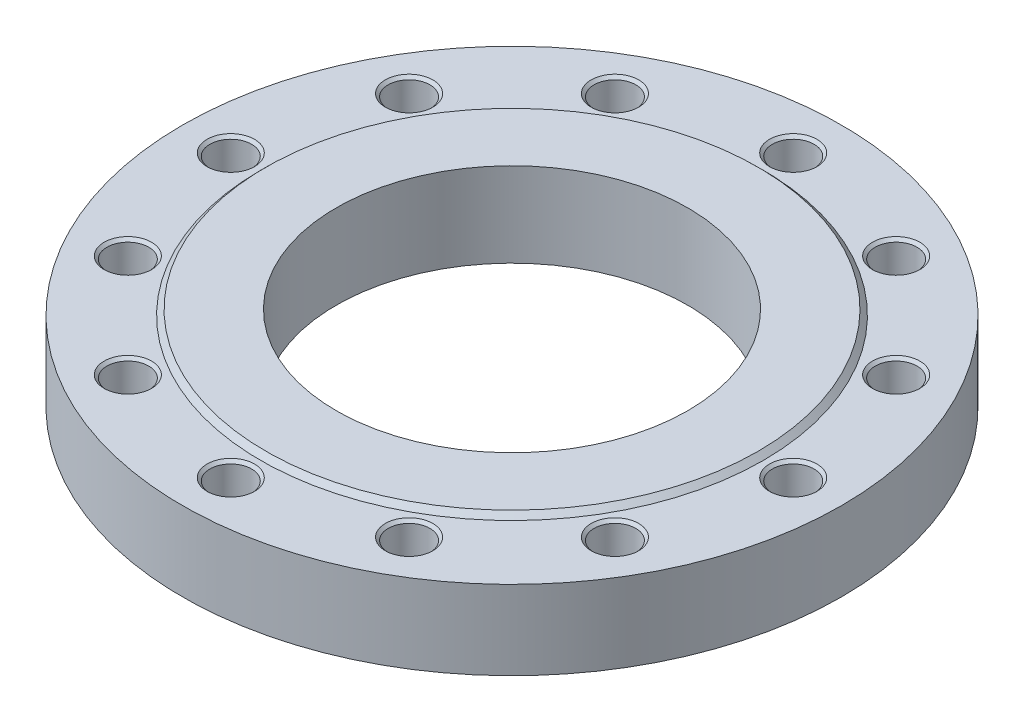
ISO-10303-21;
HEADER;
FILE_DESCRIPTION(('STEP AP214'),'2;1');
FILE_NAME('part.step','',(''),(''),'','','');
FILE_SCHEMA(('AUTOMOTIVE_DESIGN { 1 0 10303 214 1 1 1 1 }'));
ENDSEC;
DATA;
#1=APPLICATION_CONTEXT('core data for automotive mechanical design processes');
#2=APPLICATION_PROTOCOL_DEFINITION('international standard','automotive_design',2000,#1);
#3=PRODUCT_CONTEXT('',#1,'mechanical');
#4=PRODUCT('Part','Part','',(#3));
#5=PRODUCT_RELATED_PRODUCT_CATEGORY('part','',(#4));
#6=PRODUCT_DEFINITION_FORMATION('','',#4);
#7=PRODUCT_DEFINITION_CONTEXT('part definition',#1,'design');
#8=PRODUCT_DEFINITION('design','',#6,#7);
#9=PRODUCT_DEFINITION_SHAPE('','',#8);
#10=(LENGTH_UNIT() NAMED_UNIT(*) SI_UNIT(.MILLI.,.METRE.));
#11=(NAMED_UNIT(*) PLANE_ANGLE_UNIT() SI_UNIT($,.RADIAN.));
#12=(NAMED_UNIT(*) SI_UNIT($,.STERADIAN.) SOLID_ANGLE_UNIT());
#13=UNCERTAINTY_MEASURE_WITH_UNIT(LENGTH_MEASURE(1.E-05),#10,'distance_accuracy_value','');
#14=(GEOMETRIC_REPRESENTATION_CONTEXT(3) GLOBAL_UNCERTAINTY_ASSIGNED_CONTEXT((#13)) GLOBAL_UNIT_ASSIGNED_CONTEXT((#10,
#11,#12)) REPRESENTATION_CONTEXT('',''));
#15=CARTESIAN_POINT('',(0.,0.,0.));
#16=DIRECTION('',(0.,0.,1.));
#17=DIRECTION('',(1.,0.,0.));
#18=AXIS2_PLACEMENT_3D('',#15,#16,#17);
#19=CARTESIAN_POINT('',(0.,22.5,0.));
#20=DIRECTION('',(0.,-1.,0.));
#21=DIRECTION('',(1.,0.,0.));
#22=AXIS2_PLACEMENT_3D('',#19,#20,#21);
#23=CYLINDRICAL_SURFACE('',#22,187.5);
#24=CARTESIAN_POINT('',(0.,0.,0.));
#25=DIRECTION('',(0.,1.,0.));
#26=DIRECTION('',(1.,0.,0.));
#27=AXIS2_PLACEMENT_3D('',#24,#25,#26);
#28=CIRCLE('',#27,187.5);
#29=CARTESIAN_POINT('',(187.5,0.,0.));
#30=VERTEX_POINT('',#29);
#31=EDGE_CURVE('E9',#30,#30,#28,.T.);
#32=ORIENTED_EDGE('',*,*,#31,.T.);
#33=EDGE_LOOP('',(#32));
#34=FACE_BOUND('',#33,.T.);
#35=CARTESIAN_POINT('',(0.,45.,0.));
#36=DIRECTION('',(0.,1.,0.));
#37=DIRECTION('',(1.,0.,0.));
#38=AXIS2_PLACEMENT_3D('',#35,#36,#37);
#39=CIRCLE('',#38,187.5);
#40=CARTESIAN_POINT('',(187.5,45.,0.));
#41=VERTEX_POINT('',#40);
#42=EDGE_CURVE('E141',#41,#41,#39,.T.);
#43=ORIENTED_EDGE('',*,*,#42,.F.);
#44=EDGE_LOOP('',(#43));
#45=FACE_BOUND('',#44,.T.);
#46=ADVANCED_FACE('F15',(#34,#45),#23,.T.);
#47=CARTESIAN_POINT('',(143.75,0.,0.));
#48=DIRECTION('',(0.,-1.,0.));
#49=DIRECTION('',(-1.,0.,0.));
#50=AXIS2_PLACEMENT_3D('',#47,#48,#49);
#51=PLANE('',#50);
#52=CARTESIAN_POINT('',(0.,0.,0.));
#53=DIRECTION('',(0.,1.,0.));
#54=DIRECTION('',(1.,0.,0.));
#55=AXIS2_PLACEMENT_3D('',#52,#53,#54);
#56=CIRCLE('',#55,100.);
#57=CARTESIAN_POINT('',(100.,0.,0.));
#58=VERTEX_POINT('',#57);
#59=EDGE_CURVE('E19',#58,#58,#56,.T.);
#60=ORIENTED_EDGE('',*,*,#59,.T.);
#61=EDGE_LOOP('',(#60));
#62=FACE_BOUND('',#61,.T.);
#63=ORIENTED_EDGE('',*,*,#31,.F.);
#64=EDGE_LOOP('',(#63));
#65=FACE_BOUND('',#64,.T.);
#66=ADVANCED_FACE('F442',(#62,#65),#51,.T.);
#67=CARTESIAN_POINT('',(0.,24.,0.));
#68=DIRECTION('',(0.,-1.,0.));
#69=DIRECTION('',(1.,0.,0.));
#70=AXIS2_PLACEMENT_3D('',#67,#68,#69);
#71=CYLINDRICAL_SURFACE('',#70,100.);
#72=CARTESIAN_POINT('',(0.,48.,0.));
#73=DIRECTION('',(0.,1.,0.));
#74=DIRECTION('',(1.,0.,0.));
#75=AXIS2_PLACEMENT_3D('',#72,#73,#74);
#76=CIRCLE('',#75,100.);
#77=CARTESIAN_POINT('',(100.,48.,0.));
#78=VERTEX_POINT('',#77);
#79=EDGE_CURVE('E247',#78,#78,#76,.T.);
#80=ORIENTED_EDGE('',*,*,#79,.T.);
#81=EDGE_LOOP('',(#80));
#82=FACE_BOUND('',#81,.T.);
#83=ORIENTED_EDGE('',*,*,#59,.F.);
#84=EDGE_LOOP('',(#83));
#85=FACE_BOUND('',#84,.T.);
#86=ADVANCED_FACE('F447',(#82,#85),#71,.F.);
#87=CARTESIAN_POINT('',(120.,48.,0.));
#88=DIRECTION('',(0.,1.,0.));
#89=DIRECTION('',(1.,0.,0.));
#90=AXIS2_PLACEMENT_3D('',#87,#88,#89);
#91=PLANE('',#90);
#92=CARTESIAN_POINT('',(0.,48.,0.));
#93=DIRECTION('',(0.,1.,0.));
#94=DIRECTION('',(1.,0.,0.));
#95=AXIS2_PLACEMENT_3D('',#92,#93,#94);
#96=CIRCLE('',#95,140.);
#97=CARTESIAN_POINT('',(140.,48.,0.));
#98=VERTEX_POINT('',#97);
#99=EDGE_CURVE('E144',#98,#98,#96,.T.);
#100=ORIENTED_EDGE('',*,*,#99,.T.);
#101=EDGE_LOOP('',(#100));
#102=FACE_BOUND('',#101,.T.);
#103=ORIENTED_EDGE('',*,*,#79,.F.);
#104=EDGE_LOOP('',(#103));
#105=FACE_BOUND('',#104,.T.);
#106=ADVANCED_FACE('F479',(#102,#105),#91,.T.);
#107=CARTESIAN_POINT('',(0.,46.5,0.));
#108=DIRECTION('',(0.,-1.,0.));
#109=DIRECTION('',(1.,0.,0.));
#110=AXIS2_PLACEMENT_3D('',#107,#108,#109);
#111=CONICAL_SURFACE('',#110,141.5,0.785398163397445);
#112=CARTESIAN_POINT('',(0.,45.,0.));
#113=DIRECTION('',(0.,1.,0.));
#114=DIRECTION('',(1.,0.,0.));
#115=AXIS2_PLACEMENT_3D('',#112,#113,#114);
#116=CIRCLE('',#115,143.);
#117=CARTESIAN_POINT('',(143.,45.,0.));
#118=VERTEX_POINT('',#117);
#119=EDGE_CURVE('E137',#118,#118,#116,.T.);
#120=ORIENTED_EDGE('',*,*,#119,.T.);
#121=EDGE_LOOP('',(#120));
#122=FACE_BOUND('',#121,.T.);
#123=ORIENTED_EDGE('',*,*,#99,.F.);
#124=EDGE_LOOP('',(#123));
#125=FACE_BOUND('',#124,.T.);
#126=ADVANCED_FACE('F138',(#122,#125),#111,.T.);
#127=CARTESIAN_POINT('',(165.25,45.,0.));
#128=DIRECTION('',(0.,1.,0.));
#129=DIRECTION('',(1.,0.,0.));
#130=AXIS2_PLACEMENT_3D('',#127,#128,#129);
#131=PLANE('',#130);
#132=ORIENTED_EDGE('',*,*,#42,.T.);
#133=EDGE_LOOP('',(#132));
#134=FACE_BOUND('',#133,.T.);
#135=ORIENTED_EDGE('',*,*,#119,.F.);
#136=EDGE_LOOP('',(#135));
#137=FACE_BOUND('',#136,.T.);
#138=CARTESIAN_POINT('',(160.,45.,0.));
#139=DIRECTION('',(0.,-1.,0.));
#140=DIRECTION('',(1.,0.,0.));
#141=AXIS2_PLACEMENT_3D('',#138,#139,#140);
#142=CIRCLE('',#141,13.5);
#143=CARTESIAN_POINT('',(173.5,45.,0.));
#144=VERTEX_POINT('',#143);
#145=EDGE_CURVE('E238',#144,#144,#142,.T.);
#146=ORIENTED_EDGE('',*,*,#145,.T.);
#147=EDGE_LOOP('',(#146));
#148=FACE_BOUND('',#147,.T.);
#149=CARTESIAN_POINT('',(138.56406460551,45.,-80.));
#150=DIRECTION('',(0.,-1.,0.));
#151=DIRECTION('',(0.866025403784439,0.,-0.5));
#152=AXIS2_PLACEMENT_3D('',#149,#150,#151);
#153=CIRCLE('',#152,13.5);
#154=CARTESIAN_POINT('',(150.2554075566,45.,-86.75));
#155=VERTEX_POINT('',#154);
#156=EDGE_CURVE('E227',#155,#155,#153,.T.);
#157=ORIENTED_EDGE('',*,*,#156,.T.);
#158=EDGE_LOOP('',(#157));
#159=FACE_BOUND('',#158,.T.);
#160=CARTESIAN_POINT('',(80.,45.,-138.56406460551));
#161=DIRECTION('',(0.,-1.,0.));
#162=DIRECTION('',(0.5,0.,-0.866025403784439));
#163=AXIS2_PLACEMENT_3D('',#160,#161,#162);
#164=CIRCLE('',#163,13.5);
#165=CARTESIAN_POINT('',(86.75,45.,-150.2554075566));
#166=VERTEX_POINT('',#165);
#167=EDGE_CURVE('E214',#166,#166,#164,.T.);
#168=ORIENTED_EDGE('',*,*,#167,.T.);
#169=EDGE_LOOP('',(#168));
#170=FACE_BOUND('',#169,.T.);
#171=CARTESIAN_POINT('',(0.,45.,-160.));
#172=DIRECTION('',(0.,-1.,0.));
#173=DIRECTION('',(0.,0.,-1.));
#174=AXIS2_PLACEMENT_3D('',#171,#172,#173);
#175=CIRCLE('',#174,13.5);
#176=CARTESIAN_POINT('',(0.,45.,-173.5));
#177=VERTEX_POINT('',#176);
#178=EDGE_CURVE('E159',#177,#177,#175,.T.);
#179=ORIENTED_EDGE('',*,*,#178,.T.);
#180=EDGE_LOOP('',(#179));
#181=FACE_BOUND('',#180,.T.);
#182=CARTESIAN_POINT('',(-80.,45.,-138.56406460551));
#183=DIRECTION('',(0.,-1.,0.));
#184=DIRECTION('',(-0.5,0.,-0.866025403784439));
#185=AXIS2_PLACEMENT_3D('',#182,#183,#184);
#186=CIRCLE('',#185,13.5);
#187=CARTESIAN_POINT('',(-86.75,45.,-150.2554075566));
#188=VERTEX_POINT('',#187);
#189=EDGE_CURVE('E191',#188,#188,#186,.T.);
#190=ORIENTED_EDGE('',*,*,#189,.T.);
#191=EDGE_LOOP('',(#190));
#192=FACE_BOUND('',#191,.T.);
#193=CARTESIAN_POINT('',(-138.56406460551,45.,-80.));
#194=DIRECTION('',(0.,-1.,0.));
#195=DIRECTION('',(-0.866025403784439,0.,-0.5));
#196=AXIS2_PLACEMENT_3D('',#193,#194,#195);
#197=CIRCLE('',#196,13.5);
#198=CARTESIAN_POINT('',(-150.2554075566,45.,-86.75));
#199=VERTEX_POINT('',#198);
#200=EDGE_CURVE('E175',#199,#199,#197,.T.);
#201=ORIENTED_EDGE('',*,*,#200,.T.);
#202=EDGE_LOOP('',(#201));
#203=FACE_BOUND('',#202,.T.);
#204=CARTESIAN_POINT('',(-160.,45.,0.));
#205=DIRECTION('',(0.,-1.,0.));
#206=DIRECTION('',(-1.,0.,0.));
#207=AXIS2_PLACEMENT_3D('',#204,#205,#206);
#208=CIRCLE('',#207,13.5);
#209=CARTESIAN_POINT('',(-173.5,45.,0.));
#210=VERTEX_POINT('',#209);
#211=EDGE_CURVE('E155',#210,#210,#208,.T.);
#212=ORIENTED_EDGE('',*,*,#211,.T.);
#213=EDGE_LOOP('',(#212));
#214=FACE_BOUND('',#213,.T.);
#215=CARTESIAN_POINT('',(-138.56406460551,45.,80.));
#216=DIRECTION('',(0.,-1.,0.));
#217=DIRECTION('',(-0.866025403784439,0.,0.5));
#218=AXIS2_PLACEMENT_3D('',#215,#216,#217);
#219=CIRCLE('',#218,13.5);
#220=CARTESIAN_POINT('',(-150.2554075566,45.,86.75));
#221=VERTEX_POINT('',#220);
#222=EDGE_CURVE('E264',#221,#221,#219,.T.);
#223=ORIENTED_EDGE('',*,*,#222,.T.);
#224=EDGE_LOOP('',(#223));
#225=FACE_BOUND('',#224,.T.);
#226=CARTESIAN_POINT('',(-80.,45.,138.56406460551));
#227=DIRECTION('',(0.,-1.,0.));
#228=DIRECTION('',(-0.5,0.,0.866025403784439));
#229=AXIS2_PLACEMENT_3D('',#226,#227,#228);
#230=CIRCLE('',#229,13.5);
#231=CARTESIAN_POINT('',(-86.75,45.,150.2554075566));
#232=VERTEX_POINT('',#231);
#233=EDGE_CURVE('E1233',#232,#232,#230,.T.);
#234=ORIENTED_EDGE('',*,*,#233,.T.);
#235=EDGE_LOOP('',(#234));
#236=FACE_BOUND('',#235,.T.);
#237=CARTESIAN_POINT('',(0.,45.,160.));
#238=DIRECTION('',(0.,-1.,0.));
#239=DIRECTION('',(0.,0.,1.));
#240=AXIS2_PLACEMENT_3D('',#237,#238,#239);
#241=CIRCLE('',#240,13.5);
#242=CARTESIAN_POINT('',(0.,45.,173.5));
#243=VERTEX_POINT('',#242);
#244=EDGE_CURVE('E1236',#243,#243,#241,.T.);
#245=ORIENTED_EDGE('',*,*,#244,.T.);
#246=EDGE_LOOP('',(#245));
#247=FACE_BOUND('',#246,.T.);
#248=CARTESIAN_POINT('',(80.,45.,138.56406460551));
#249=DIRECTION('',(0.,-1.,0.));
#250=DIRECTION('',(0.5,0.,0.866025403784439));
#251=AXIS2_PLACEMENT_3D('',#248,#249,#250);
#252=CIRCLE('',#251,13.5);
#253=CARTESIAN_POINT('',(86.75,45.,150.2554075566));
#254=VERTEX_POINT('',#253);
#255=EDGE_CURVE('E1239',#254,#254,#252,.T.);
#256=ORIENTED_EDGE('',*,*,#255,.T.);
#257=EDGE_LOOP('',(#256));
#258=FACE_BOUND('',#257,.T.);
#259=CARTESIAN_POINT('',(138.56406460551,45.,80.));
#260=DIRECTION('',(0.,-1.,0.));
#261=DIRECTION('',(0.866025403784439,0.,0.5));
#262=AXIS2_PLACEMENT_3D('',#259,#260,#261);
#263=CIRCLE('',#262,13.5);
#264=CARTESIAN_POINT('',(150.2554075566,45.,86.75));
#265=VERTEX_POINT('',#264);
#266=EDGE_CURVE('E1241',#265,#265,#263,.T.);
#267=ORIENTED_EDGE('',*,*,#266,.T.);
#268=EDGE_LOOP('',(#267));
#269=FACE_BOUND('',#268,.T.);
#270=ADVANCED_FACE('F17',(#134,#137,#148,#159,#170,#181,#192,#203,#214,#225,#236,#247,#258,
#269),#131,.T.);
#271=CARTESIAN_POINT('',(160.,5.57162193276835,0.));
#272=DIRECTION('',(0.,1.,0.));
#273=DIRECTION('',(1.,0.,0.));
#274=AXIS2_PLACEMENT_3D('',#271,#272,#273);
#275=CONICAL_SURFACE('',#274,5.938125,1.0471975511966);
#276=CARTESIAN_POINT('',(160.,9.,0.));
#277=DIRECTION('',(0.,-1.,0.));
#278=DIRECTION('',(1.,0.,0.));
#279=AXIS2_PLACEMENT_3D('',#276,#277,#278);
#280=CIRCLE('',#279,11.87625);
#281=CARTESIAN_POINT('',(171.87625,9.,0.));
#282=VERTEX_POINT('',#281);
#283=EDGE_CURVE('E142',#282,#282,#280,.T.);
#284=ORIENTED_EDGE('',*,*,#283,.F.);
#285=EDGE_LOOP('',(#284));
#286=FACE_BOUND('',#285,.T.);
#287=CARTESIAN_POINT('',(160.,2.1432438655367,0.));
#288=VERTEX_POINT('',#287);
#289=VERTEX_LOOP('',#288);
#290=FACE_BOUND('',#289,.T.);
#291=ADVANCED_FACE('F582',(#286,#290),#275,.F.);
#292=CARTESIAN_POINT('',(160.,13.688125,0.));
#293=DIRECTION('',(0.,1.,0.));
#294=DIRECTION('',(1.,0.,0.));
#295=AXIS2_PLACEMENT_3D('',#292,#293,#294);
#296=CYLINDRICAL_SURFACE('',#295,11.87625);
#297=CARTESIAN_POINT('',(160.,18.37625,0.));
#298=DIRECTION('',(0.,-1.,0.));
#299=DIRECTION('',(1.,0.,0.));
#300=AXIS2_PLACEMENT_3D('',#297,#298,#299);
#301=CIRCLE('',#300,11.87625);
#302=CARTESIAN_POINT('',(171.87625,18.37625,0.));
#303=VERTEX_POINT('',#302);
#304=EDGE_CURVE('E146',#303,#303,#301,.T.);
#305=ORIENTED_EDGE('',*,*,#304,.F.);
#306=EDGE_LOOP('',(#305));
#307=FACE_BOUND('',#306,.T.);
#308=ORIENTED_EDGE('',*,*,#283,.T.);
#309=EDGE_LOOP('',(#308));
#310=FACE_BOUND('',#309,.T.);
#311=ADVANCED_FACE('F579',(#307,#310),#296,.F.);
#312=CARTESIAN_POINT('',(160.,19.188125,0.));
#313=DIRECTION('',(0.,1.,0.));
#314=DIRECTION('',(1.,0.,0.));
#315=AXIS2_PLACEMENT_3D('',#312,#313,#314);
#316=CONICAL_SURFACE('',#315,12.688125,0.785398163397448);
#317=CARTESIAN_POINT('',(160.,20.,0.));
#318=DIRECTION('',(0.,-1.,0.));
#319=DIRECTION('',(1.,0.,0.));
#320=AXIS2_PLACEMENT_3D('',#317,#318,#319);
#321=CIRCLE('',#320,13.5);
#322=CARTESIAN_POINT('',(173.5,20.,0.));
#323=VERTEX_POINT('',#322);
#324=EDGE_CURVE('E242',#323,#323,#321,.T.);
#325=ORIENTED_EDGE('',*,*,#324,.F.);
#326=EDGE_LOOP('',(#325));
#327=FACE_BOUND('',#326,.T.);
#328=ORIENTED_EDGE('',*,*,#304,.T.);
#329=EDGE_LOOP('',(#328));
#330=FACE_BOUND('',#329,.T.);
#331=ADVANCED_FACE('F576',(#327,#330),#316,.F.);
#332=CARTESIAN_POINT('',(172.688125,20.,0.));
#333=DIRECTION('',(0.,1.,0.));
#334=DIRECTION('',(-1.,0.,0.));
#335=AXIS2_PLACEMENT_3D('',#332,#333,#334);
#336=PLANE('',#335);
#337=CARTESIAN_POINT('',(160.,20.,0.));
#338=DIRECTION('',(0.,-1.,0.));
#339=DIRECTION('',(1.,0.,0.));
#340=AXIS2_PLACEMENT_3D('',#337,#338,#339);
#341=CIRCLE('',#340,11.87625);
#342=CARTESIAN_POINT('',(171.87625,20.,0.));
#343=VERTEX_POINT('',#342);
#344=EDGE_CURVE('E240',#343,#343,#341,.T.);
#345=ORIENTED_EDGE('',*,*,#344,.F.);
#346=EDGE_LOOP('',(#345));
#347=FACE_BOUND('',#346,.T.);
#348=ORIENTED_EDGE('',*,*,#324,.T.);
#349=EDGE_LOOP('',(#348));
#350=FACE_BOUND('',#349,.T.);
#351=ADVANCED_FACE('F572',(#347,#350),#336,.F.);
#352=CARTESIAN_POINT('',(160.,31.688125,0.));
#353=DIRECTION('',(0.,1.,0.));
#354=DIRECTION('',(1.,0.,0.));
#355=AXIS2_PLACEMENT_3D('',#352,#353,#354);
#356=CYLINDRICAL_SURFACE('',#355,11.87625);
#357=CARTESIAN_POINT('',(160.,43.37625,0.));
#358=DIRECTION('',(0.,-1.,0.));
#359=DIRECTION('',(1.,0.,0.));
#360=AXIS2_PLACEMENT_3D('',#357,#358,#359);
#361=CIRCLE('',#360,11.87625);
#362=CARTESIAN_POINT('',(171.87625,43.37625,0.));
#363=VERTEX_POINT('',#362);
#364=EDGE_CURVE('E236',#363,#363,#361,.T.);
#365=ORIENTED_EDGE('',*,*,#364,.F.);
#366=EDGE_LOOP('',(#365));
#367=FACE_BOUND('',#366,.T.);
#368=ORIENTED_EDGE('',*,*,#344,.T.);
#369=EDGE_LOOP('',(#368));
#370=FACE_BOUND('',#369,.T.);
#371=ADVANCED_FACE('F568',(#367,#370),#356,.F.);
#372=CARTESIAN_POINT('',(160.,44.188125,0.));
#373=DIRECTION('',(0.,1.,0.));
#374=DIRECTION('',(1.,0.,0.));
#375=AXIS2_PLACEMENT_3D('',#372,#373,#374);
#376=CONICAL_SURFACE('',#375,12.688125,0.785398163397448);
#377=ORIENTED_EDGE('',*,*,#145,.F.);
#378=EDGE_LOOP('',(#377));
#379=FACE_BOUND('',#378,.T.);
#380=ORIENTED_EDGE('',*,*,#364,.T.);
#381=EDGE_LOOP('',(#380));
#382=FACE_BOUND('',#381,.T.);
#383=ADVANCED_FACE('F571',(#379,#382),#376,.F.);
#384=CARTESIAN_POINT('',(138.56406460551,5.57162193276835,-80.));
#385=DIRECTION('',(0.,1.,0.));
#386=DIRECTION('',(0.866025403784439,0.,-0.5));
#387=AXIS2_PLACEMENT_3D('',#384,#385,#386);
#388=CONICAL_SURFACE('',#387,5.938125,1.0471975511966);
#389=CARTESIAN_POINT('',(138.56406460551,9.,-80.));
#390=DIRECTION('',(0.,-1.,0.));
#391=DIRECTION('',(0.866025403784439,0.,-0.5));
#392=AXIS2_PLACEMENT_3D('',#389,#390,#391);
#393=CIRCLE('',#392,11.87625);
#394=CARTESIAN_POINT('',(148.849198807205,9.,-85.938125));
#395=VERTEX_POINT('',#394);
#396=EDGE_CURVE('E234',#395,#395,#393,.T.);
#397=ORIENTED_EDGE('',*,*,#396,.F.);
#398=EDGE_LOOP('',(#397));
#399=FACE_BOUND('',#398,.T.);
#400=CARTESIAN_POINT('',(138.56406460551,2.1432438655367,-80.));
#401=VERTEX_POINT('',#400);
#402=VERTEX_LOOP('',#401);
#403=FACE_BOUND('',#402,.T.);
#404=ADVANCED_FACE('F566',(#399,#403),#388,.F.);
#405=CARTESIAN_POINT('',(138.56406460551,13.688125,-80.));
#406=DIRECTION('',(0.,1.,0.));
#407=DIRECTION('',(0.866025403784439,0.,-0.5));
#408=AXIS2_PLACEMENT_3D('',#405,#406,#407);
#409=CYLINDRICAL_SURFACE('',#408,11.87625);
#410=CARTESIAN_POINT('',(138.56406460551,18.37625,-80.));
#411=DIRECTION('',(0.,-1.,0.));
#412=DIRECTION('',(0.866025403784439,0.,-0.5));
#413=AXIS2_PLACEMENT_3D('',#410,#411,#412);
#414=CIRCLE('',#413,11.87625);
#415=CARTESIAN_POINT('',(148.849198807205,18.37625,-85.938125));
#416=VERTEX_POINT('',#415);
#417=EDGE_CURVE('E232',#416,#416,#414,.T.);
#418=ORIENTED_EDGE('',*,*,#417,.F.);
#419=EDGE_LOOP('',(#418));
#420=FACE_BOUND('',#419,.T.);
#421=ORIENTED_EDGE('',*,*,#396,.T.);
#422=EDGE_LOOP('',(#421));
#423=FACE_BOUND('',#422,.T.);
#424=ADVANCED_FACE('F562',(#420,#423),#409,.F.);
#425=CARTESIAN_POINT('',(138.56406460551,19.188125,-80.));
#426=DIRECTION('',(0.,1.,0.));
#427=DIRECTION('',(0.866025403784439,0.,-0.5));
#428=AXIS2_PLACEMENT_3D('',#425,#426,#427);
#429=CONICAL_SURFACE('',#428,12.688125,0.785398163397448);
#430=CARTESIAN_POINT('',(138.56406460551,20.,-80.));
#431=DIRECTION('',(0.,-1.,0.));
#432=DIRECTION('',(0.866025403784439,0.,-0.5));
#433=AXIS2_PLACEMENT_3D('',#430,#431,#432);
#434=CIRCLE('',#433,13.5);
#435=CARTESIAN_POINT('',(150.2554075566,20.,-86.75));
#436=VERTEX_POINT('',#435);
#437=EDGE_CURVE('E230',#436,#436,#434,.T.);
#438=ORIENTED_EDGE('',*,*,#437,.F.);
#439=EDGE_LOOP('',(#438));
#440=FACE_BOUND('',#439,.T.);
#441=ORIENTED_EDGE('',*,*,#417,.T.);
#442=EDGE_LOOP('',(#441));
#443=FACE_BOUND('',#442,.T.);
#444=ADVANCED_FACE('F558',(#440,#443),#429,.F.);
#445=CARTESIAN_POINT('',(149.552303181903,20.,-86.3440625));
#446=DIRECTION('',(0.,1.,0.));
#447=DIRECTION('',(-0.866025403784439,0.,0.5));
#448=AXIS2_PLACEMENT_3D('',#445,#446,#447);
#449=PLANE('',#448);
#450=CARTESIAN_POINT('',(138.56406460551,20.,-80.));
#451=DIRECTION('',(0.,-1.,0.));
#452=DIRECTION('',(0.866025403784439,0.,-0.5));
#453=AXIS2_PLACEMENT_3D('',#450,#451,#452);
#454=CIRCLE('',#453,11.87625);
#455=CARTESIAN_POINT('',(148.849198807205,20.,-85.938125));
#456=VERTEX_POINT('',#455);
#457=EDGE_CURVE('E228',#456,#456,#454,.T.);
#458=ORIENTED_EDGE('',*,*,#457,.F.);
#459=EDGE_LOOP('',(#458));
#460=FACE_BOUND('',#459,.T.);
#461=ORIENTED_EDGE('',*,*,#437,.T.);
#462=EDGE_LOOP('',(#461));
#463=FACE_BOUND('',#462,.T.);
#464=ADVANCED_FACE('F554',(#460,#463),#449,.F.);
#465=CARTESIAN_POINT('',(138.56406460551,31.688125,-80.));
#466=DIRECTION('',(0.,1.,0.));
#467=DIRECTION('',(0.866025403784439,0.,-0.5));
#468=AXIS2_PLACEMENT_3D('',#465,#466,#467);
#469=CYLINDRICAL_SURFACE('',#468,11.87625);
#470=CARTESIAN_POINT('',(138.56406460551,43.37625,-80.));
#471=DIRECTION('',(0.,-1.,0.));
#472=DIRECTION('',(0.866025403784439,0.,-0.5));
#473=AXIS2_PLACEMENT_3D('',#470,#471,#472);
#474=CIRCLE('',#473,11.87625);
#475=CARTESIAN_POINT('',(148.849198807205,43.37625,-85.938125));
#476=VERTEX_POINT('',#475);
#477=EDGE_CURVE('E225',#476,#476,#474,.T.);
#478=ORIENTED_EDGE('',*,*,#477,.F.);
#479=EDGE_LOOP('',(#478));
#480=FACE_BOUND('',#479,.T.);
#481=ORIENTED_EDGE('',*,*,#457,.T.);
#482=EDGE_LOOP('',(#481));
#483=FACE_BOUND('',#482,.T.);
#484=ADVANCED_FACE('F550',(#480,#483),#469,.F.);
#485=CARTESIAN_POINT('',(138.56406460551,44.188125,-80.));
#486=DIRECTION('',(0.,1.,0.));
#487=DIRECTION('',(0.866025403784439,0.,-0.5));
#488=AXIS2_PLACEMENT_3D('',#485,#486,#487);
#489=CONICAL_SURFACE('',#488,12.688125,0.785398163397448);
#490=ORIENTED_EDGE('',*,*,#156,.F.);
#491=EDGE_LOOP('',(#490));
#492=FACE_BOUND('',#491,.T.);
#493=ORIENTED_EDGE('',*,*,#477,.T.);
#494=EDGE_LOOP('',(#493));
#495=FACE_BOUND('',#494,.T.);
#496=ADVANCED_FACE('F546',(#492,#495),#489,.F.);
#497=CARTESIAN_POINT('',(80.,5.57162193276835,-138.56406460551));
#498=DIRECTION('',(0.,1.,0.));
#499=DIRECTION('',(0.5,0.,-0.866025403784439));
#500=AXIS2_PLACEMENT_3D('',#497,#498,#499);
#501=CONICAL_SURFACE('',#500,5.938125,1.0471975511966);
#502=CARTESIAN_POINT('',(80.,9.,-138.56406460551));
#503=DIRECTION('',(0.,-1.,0.));
#504=DIRECTION('',(0.5,0.,-0.866025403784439));
#505=AXIS2_PLACEMENT_3D('',#502,#503,#504);
#506=CIRCLE('',#505,11.87625);
#507=CARTESIAN_POINT('',(85.938125,9.,-148.849198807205));
#508=VERTEX_POINT('',#507);
#509=EDGE_CURVE('E222',#508,#508,#506,.T.);
#510=ORIENTED_EDGE('',*,*,#509,.F.);
#511=EDGE_LOOP('',(#510));
#512=FACE_BOUND('',#511,.T.);
#513=CARTESIAN_POINT('',(80.,2.1432438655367,-138.56406460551));
#514=VERTEX_POINT('',#513);
#515=VERTEX_LOOP('',#514);
#516=FACE_BOUND('',#515,.T.);
#517=ADVANCED_FACE('F542',(#512,#516),#501,.F.);
#518=CARTESIAN_POINT('',(80.,13.688125,-138.56406460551));
#519=DIRECTION('',(0.,1.,0.));
#520=DIRECTION('',(0.5,0.,-0.866025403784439));
#521=AXIS2_PLACEMENT_3D('',#518,#519,#520);
#522=CYLINDRICAL_SURFACE('',#521,11.87625);
#523=CARTESIAN_POINT('',(80.,18.37625,-138.56406460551));
#524=DIRECTION('',(0.,-1.,0.));
#525=DIRECTION('',(0.5,0.,-0.866025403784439));
#526=AXIS2_PLACEMENT_3D('',#523,#524,#525);
#527=CIRCLE('',#526,11.87625);
#528=CARTESIAN_POINT('',(85.938125,18.37625,-148.849198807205));
#529=VERTEX_POINT('',#528);
#530=EDGE_CURVE('E220',#529,#529,#527,.T.);
#531=ORIENTED_EDGE('',*,*,#530,.F.);
#532=EDGE_LOOP('',(#531));
#533=FACE_BOUND('',#532,.T.);
#534=ORIENTED_EDGE('',*,*,#509,.T.);
#535=EDGE_LOOP('',(#534));
#536=FACE_BOUND('',#535,.T.);
#537=ADVANCED_FACE('F538',(#533,#536),#522,.F.);
#538=CARTESIAN_POINT('',(80.,19.188125,-138.56406460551));
#539=DIRECTION('',(0.,1.,0.));
#540=DIRECTION('',(0.5,0.,-0.866025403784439));
#541=AXIS2_PLACEMENT_3D('',#538,#539,#540);
#542=CONICAL_SURFACE('',#541,12.688125,0.785398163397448);
#543=CARTESIAN_POINT('',(80.,20.,-138.56406460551));
#544=DIRECTION('',(0.,-1.,0.));
#545=DIRECTION('',(0.5,0.,-0.866025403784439));
#546=AXIS2_PLACEMENT_3D('',#543,#544,#545);
#547=CIRCLE('',#546,13.5);
#548=CARTESIAN_POINT('',(86.75,20.,-150.2554075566));
#549=VERTEX_POINT('',#548);
#550=EDGE_CURVE('E219',#549,#549,#547,.T.);
#551=ORIENTED_EDGE('',*,*,#550,.F.);
#552=EDGE_LOOP('',(#551));
#553=FACE_BOUND('',#552,.T.);
#554=ORIENTED_EDGE('',*,*,#530,.T.);
#555=EDGE_LOOP('',(#554));
#556=FACE_BOUND('',#555,.T.);
#557=ADVANCED_FACE('F471',(#553,#556),#542,.F.);
#558=CARTESIAN_POINT('',(86.3440625,20.,-149.552303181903));
#559=DIRECTION('',(0.,1.,0.));
#560=DIRECTION('',(-0.5,0.,0.866025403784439));
#561=AXIS2_PLACEMENT_3D('',#558,#559,#560);
#562=PLANE('',#561);
#563=CARTESIAN_POINT('',(80.,20.,-138.56406460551));
#564=DIRECTION('',(0.,-1.,0.));
#565=DIRECTION('',(0.5,0.,-0.866025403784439));
#566=AXIS2_PLACEMENT_3D('',#563,#564,#565);
#567=CIRCLE('',#566,11.87625);
#568=CARTESIAN_POINT('',(85.938125,20.,-148.849198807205));
#569=VERTEX_POINT('',#568);
#570=EDGE_CURVE('E217',#569,#569,#567,.T.);
#571=ORIENTED_EDGE('',*,*,#570,.F.);
#572=EDGE_LOOP('',(#571));
#573=FACE_BOUND('',#572,.T.);
#574=ORIENTED_EDGE('',*,*,#550,.T.);
#575=EDGE_LOOP('',(#574));
#576=FACE_BOUND('',#575,.T.);
#577=ADVANCED_FACE('F467',(#573,#576),#562,.F.);
#578=CARTESIAN_POINT('',(80.,31.688125,-138.56406460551));
#579=DIRECTION('',(0.,1.,0.));
#580=DIRECTION('',(0.5,0.,-0.866025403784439));
#581=AXIS2_PLACEMENT_3D('',#578,#579,#580);
#582=CYLINDRICAL_SURFACE('',#581,11.87625);
#583=CARTESIAN_POINT('',(80.,43.37625,-138.56406460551));
#584=DIRECTION('',(0.,-1.,0.));
#585=DIRECTION('',(0.5,0.,-0.866025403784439));
#586=AXIS2_PLACEMENT_3D('',#583,#584,#585);
#587=CIRCLE('',#586,11.87625);
#588=CARTESIAN_POINT('',(85.938125,43.37625,-148.849198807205));
#589=VERTEX_POINT('',#588);
#590=EDGE_CURVE('E212',#589,#589,#587,.T.);
#591=ORIENTED_EDGE('',*,*,#590,.F.);
#592=EDGE_LOOP('',(#591));
#593=FACE_BOUND('',#592,.T.);
#594=ORIENTED_EDGE('',*,*,#570,.T.);
#595=EDGE_LOOP('',(#594));
#596=FACE_BOUND('',#595,.T.);
#597=ADVANCED_FACE('F470',(#593,#596),#582,.F.);
#598=CARTESIAN_POINT('',(80.,44.188125,-138.56406460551));
#599=DIRECTION('',(0.,1.,0.));
#600=DIRECTION('',(0.5,0.,-0.866025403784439));
#601=AXIS2_PLACEMENT_3D('',#598,#599,#600);
#602=CONICAL_SURFACE('',#601,12.688125,0.785398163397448);
#603=ORIENTED_EDGE('',*,*,#167,.F.);
#604=EDGE_LOOP('',(#603));
#605=FACE_BOUND('',#604,.T.);
#606=ORIENTED_EDGE('',*,*,#590,.T.);
#607=EDGE_LOOP('',(#606));
#608=FACE_BOUND('',#607,.T.);
#609=ADVANCED_FACE('F531',(#605,#608),#602,.F.);
#610=CARTESIAN_POINT('',(0.,5.57162193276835,-160.));
#611=DIRECTION('',(0.,1.,0.));
#612=DIRECTION('',(0.,0.,-1.));
#613=AXIS2_PLACEMENT_3D('',#610,#611,#612);
#614=CONICAL_SURFACE('',#613,5.938125,1.0471975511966);
#615=CARTESIAN_POINT('',(0.,9.,-160.));
#616=DIRECTION('',(0.,-1.,0.));
#617=DIRECTION('',(0.,0.,-1.));
#618=AXIS2_PLACEMENT_3D('',#615,#616,#617);
#619=CIRCLE('',#618,11.87625);
#620=CARTESIAN_POINT('',(0.,9.,-171.87625));
#621=VERTEX_POINT('',#620);
#622=EDGE_CURVE('E209',#621,#621,#619,.T.);
#623=ORIENTED_EDGE('',*,*,#622,.F.);
#624=EDGE_LOOP('',(#623));
#625=FACE_BOUND('',#624,.T.);
#626=CARTESIAN_POINT('',(0.,2.1432438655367,-160.));
#627=VERTEX_POINT('',#626);
#628=VERTEX_LOOP('',#627);
#629=FACE_BOUND('',#628,.T.);
#630=ADVANCED_FACE('F528',(#625,#629),#614,.F.);
#631=CARTESIAN_POINT('',(0.,13.688125,-160.));
#632=DIRECTION('',(0.,1.,0.));
#633=DIRECTION('',(0.,0.,-1.));
#634=AXIS2_PLACEMENT_3D('',#631,#632,#633);
#635=CYLINDRICAL_SURFACE('',#634,11.87625);
#636=CARTESIAN_POINT('',(0.,18.37625,-160.));
#637=DIRECTION('',(0.,-1.,0.));
#638=DIRECTION('',(0.,0.,-1.));
#639=AXIS2_PLACEMENT_3D('',#636,#637,#638);
#640=CIRCLE('',#639,11.87625);
#641=CARTESIAN_POINT('',(0.,18.37625,-171.87625));
#642=VERTEX_POINT('',#641);
#643=EDGE_CURVE('E207',#642,#642,#640,.T.);
#644=ORIENTED_EDGE('',*,*,#643,.F.);
#645=EDGE_LOOP('',(#644));
#646=FACE_BOUND('',#645,.T.);
#647=ORIENTED_EDGE('',*,*,#622,.T.);
#648=EDGE_LOOP('',(#647));
#649=FACE_BOUND('',#648,.T.);
#650=ADVANCED_FACE('F526',(#646,#649),#635,.F.);
#651=CARTESIAN_POINT('',(0.,19.188125,-160.));
#652=DIRECTION('',(0.,1.,0.));
#653=DIRECTION('',(0.,0.,-1.));
#654=AXIS2_PLACEMENT_3D('',#651,#652,#653);
#655=CONICAL_SURFACE('',#654,12.688125,0.785398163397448);
#656=CARTESIAN_POINT('',(0.,20.,-160.));
#657=DIRECTION('',(0.,-1.,0.));
#658=DIRECTION('',(0.,0.,-1.));
#659=AXIS2_PLACEMENT_3D('',#656,#657,#658);
#660=CIRCLE('',#659,13.5);
#661=CARTESIAN_POINT('',(0.,20.,-173.5));
#662=VERTEX_POINT('',#661);
#663=EDGE_CURVE('E158',#662,#662,#660,.T.);
#664=ORIENTED_EDGE('',*,*,#663,.F.);
#665=EDGE_LOOP('',(#664));
#666=FACE_BOUND('',#665,.T.);
#667=ORIENTED_EDGE('',*,*,#643,.T.);
#668=EDGE_LOOP('',(#667));
#669=FACE_BOUND('',#668,.T.);
#670=ADVANCED_FACE('F522',(#666,#669),#655,.F.);
#671=CARTESIAN_POINT('',(0.,20.,-172.688125));
#672=DIRECTION('',(0.,1.,0.));
#673=DIRECTION('',(0.,0.,1.));
#674=AXIS2_PLACEMENT_3D('',#671,#672,#673);
#675=PLANE('',#674);
#676=CARTESIAN_POINT('',(0.,20.,-160.));
#677=DIRECTION('',(0.,-1.,0.));
#678=DIRECTION('',(0.,0.,-1.));
#679=AXIS2_PLACEMENT_3D('',#676,#677,#678);
#680=CIRCLE('',#679,11.87625);
#681=CARTESIAN_POINT('',(0.,20.,-171.87625));
#682=VERTEX_POINT('',#681);
#683=EDGE_CURVE('E156',#682,#682,#680,.T.);
#684=ORIENTED_EDGE('',*,*,#683,.F.);
#685=EDGE_LOOP('',(#684));
#686=FACE_BOUND('',#685,.T.);
#687=ORIENTED_EDGE('',*,*,#663,.T.);
#688=EDGE_LOOP('',(#687));
#689=FACE_BOUND('',#688,.T.);
#690=ADVANCED_FACE('F518',(#686,#689),#675,.F.);
#691=CARTESIAN_POINT('',(0.,31.688125,-160.));
#692=DIRECTION('',(0.,1.,0.));
#693=DIRECTION('',(0.,0.,-1.));
#694=AXIS2_PLACEMENT_3D('',#691,#692,#693);
#695=CYLINDRICAL_SURFACE('',#694,11.87625);
#696=CARTESIAN_POINT('',(0.,43.37625,-160.));
#697=DIRECTION('',(0.,-1.,0.));
#698=DIRECTION('',(0.,0.,-1.));
#699=AXIS2_PLACEMENT_3D('',#696,#697,#698);
#700=CIRCLE('',#699,11.87625);
#701=CARTESIAN_POINT('',(0.,43.37625,-171.87625));
#702=VERTEX_POINT('',#701);
#703=EDGE_CURVE('E202',#702,#702,#700,.T.);
#704=ORIENTED_EDGE('',*,*,#703,.F.);
#705=EDGE_LOOP('',(#704));
#706=FACE_BOUND('',#705,.T.);
#707=ORIENTED_EDGE('',*,*,#683,.T.);
#708=EDGE_LOOP('',(#707));
#709=FACE_BOUND('',#708,.T.);
#710=ADVANCED_FACE('F514',(#706,#709),#695,.F.);
#711=CARTESIAN_POINT('',(0.,44.188125,-160.));
#712=DIRECTION('',(0.,1.,0.));
#713=DIRECTION('',(0.,0.,-1.));
#714=AXIS2_PLACEMENT_3D('',#711,#712,#713);
#715=CONICAL_SURFACE('',#714,12.688125,0.785398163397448);
#716=ORIENTED_EDGE('',*,*,#178,.F.);
#717=EDGE_LOOP('',(#716));
#718=FACE_BOUND('',#717,.T.);
#719=ORIENTED_EDGE('',*,*,#703,.T.);
#720=EDGE_LOOP('',(#719));
#721=FACE_BOUND('',#720,.T.);
#722=ADVANCED_FACE('F511',(#718,#721),#715,.F.);
#723=CARTESIAN_POINT('',(-80.,5.57162193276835,-138.56406460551));
#724=DIRECTION('',(0.,1.,0.));
#725=DIRECTION('',(-0.5,0.,-0.866025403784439));
#726=AXIS2_PLACEMENT_3D('',#723,#724,#725);
#727=CONICAL_SURFACE('',#726,5.938125,1.0471975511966);
#728=CARTESIAN_POINT('',(-80.,9.,-138.56406460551));
#729=DIRECTION('',(0.,-1.,0.));
#730=DIRECTION('',(-0.5,0.,-0.866025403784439));
#731=AXIS2_PLACEMENT_3D('',#728,#729,#730);
#732=CIRCLE('',#731,11.87625);
#733=CARTESIAN_POINT('',(-85.938125,9.,-148.849198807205));
#734=VERTEX_POINT('',#733);
#735=EDGE_CURVE('E200',#734,#734,#732,.T.);
#736=ORIENTED_EDGE('',*,*,#735,.F.);
#737=EDGE_LOOP('',(#736));
#738=FACE_BOUND('',#737,.T.);
#739=CARTESIAN_POINT('',(-80.,2.1432438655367,-138.56406460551));
#740=VERTEX_POINT('',#739);
#741=VERTEX_LOOP('',#740);
#742=FACE_BOUND('',#741,.T.);
#743=ADVANCED_FACE('F509',(#738,#742),#727,.F.);
#744=CARTESIAN_POINT('',(-80.,13.688125,-138.56406460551));
#745=DIRECTION('',(0.,1.,0.));
#746=DIRECTION('',(-0.5,0.,-0.866025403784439));
#747=AXIS2_PLACEMENT_3D('',#744,#745,#746);
#748=CYLINDRICAL_SURFACE('',#747,11.87625);
#749=CARTESIAN_POINT('',(-80.,18.37625,-138.56406460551));
#750=DIRECTION('',(0.,-1.,0.));
#751=DIRECTION('',(-0.5,0.,-0.866025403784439));
#752=AXIS2_PLACEMENT_3D('',#749,#750,#751);
#753=CIRCLE('',#752,11.87625);
#754=CARTESIAN_POINT('',(-85.938125,18.37625,-148.849198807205));
#755=VERTEX_POINT('',#754);
#756=EDGE_CURVE('E198',#755,#755,#753,.T.);
#757=ORIENTED_EDGE('',*,*,#756,.F.);
#758=EDGE_LOOP('',(#757));
#759=FACE_BOUND('',#758,.T.);
#760=ORIENTED_EDGE('',*,*,#735,.T.);
#761=EDGE_LOOP('',(#760));
#762=FACE_BOUND('',#761,.T.);
#763=ADVANCED_FACE('F505',(#759,#762),#748,.F.);
#764=CARTESIAN_POINT('',(-80.,19.188125,-138.56406460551));
#765=DIRECTION('',(0.,1.,0.));
#766=DIRECTION('',(-0.5,0.,-0.866025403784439));
#767=AXIS2_PLACEMENT_3D('',#764,#765,#766);
#768=CONICAL_SURFACE('',#767,12.688125,0.785398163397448);
#769=CARTESIAN_POINT('',(-80.,20.,-138.56406460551));
#770=DIRECTION('',(0.,-1.,0.));
#771=DIRECTION('',(-0.5,0.,-0.866025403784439));
#772=AXIS2_PLACEMENT_3D('',#769,#770,#771);
#773=CIRCLE('',#772,13.5);
#774=CARTESIAN_POINT('',(-86.75,20.,-150.2554075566));
#775=VERTEX_POINT('',#774);
#776=EDGE_CURVE('E196',#775,#775,#773,.T.);
#777=ORIENTED_EDGE('',*,*,#776,.F.);
#778=EDGE_LOOP('',(#777));
#779=FACE_BOUND('',#778,.T.);
#780=ORIENTED_EDGE('',*,*,#756,.T.);
#781=EDGE_LOOP('',(#780));
#782=FACE_BOUND('',#781,.T.);
#783=ADVANCED_FACE('F501',(#779,#782),#768,.F.);
#784=CARTESIAN_POINT('',(-86.3440625,20.,-149.552303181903));
#785=DIRECTION('',(0.,1.,0.));
#786=DIRECTION('',(0.5,0.,0.866025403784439));
#787=AXIS2_PLACEMENT_3D('',#784,#785,#786);
#788=PLANE('',#787);
#789=CARTESIAN_POINT('',(-80.,20.,-138.56406460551));
#790=DIRECTION('',(0.,-1.,0.));
#791=DIRECTION('',(-0.5,0.,-0.866025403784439));
#792=AXIS2_PLACEMENT_3D('',#789,#790,#791);
#793=CIRCLE('',#792,11.87625);
#794=CARTESIAN_POINT('',(-85.938125,20.,-148.849198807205));
#795=VERTEX_POINT('',#794);
#796=EDGE_CURVE('E193',#795,#795,#793,.T.);
#797=ORIENTED_EDGE('',*,*,#796,.F.);
#798=EDGE_LOOP('',(#797));
#799=FACE_BOUND('',#798,.T.);
#800=ORIENTED_EDGE('',*,*,#776,.T.);
#801=EDGE_LOOP('',(#800));
#802=FACE_BOUND('',#801,.T.);
#803=ADVANCED_FACE('F497',(#799,#802),#788,.F.);
#804=CARTESIAN_POINT('',(-80.,31.688125,-138.56406460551));
#805=DIRECTION('',(0.,1.,0.));
#806=DIRECTION('',(-0.5,0.,-0.866025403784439));
#807=AXIS2_PLACEMENT_3D('',#804,#805,#806);
#808=CYLINDRICAL_SURFACE('',#807,11.87625);
#809=CARTESIAN_POINT('',(-80.,43.37625,-138.56406460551));
#810=DIRECTION('',(0.,-1.,0.));
#811=DIRECTION('',(-0.5,0.,-0.866025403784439));
#812=AXIS2_PLACEMENT_3D('',#809,#810,#811);
#813=CIRCLE('',#812,11.87625);
#814=CARTESIAN_POINT('',(-85.938125,43.37625,-148.849198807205));
#815=VERTEX_POINT('',#814);
#816=EDGE_CURVE('E189',#815,#815,#813,.T.);
#817=ORIENTED_EDGE('',*,*,#816,.F.);
#818=EDGE_LOOP('',(#817));
#819=FACE_BOUND('',#818,.T.);
#820=ORIENTED_EDGE('',*,*,#796,.T.);
#821=EDGE_LOOP('',(#820));
#822=FACE_BOUND('',#821,.T.);
#823=ADVANCED_FACE('F491',(#819,#822),#808,.F.);
#824=CARTESIAN_POINT('',(-80.,44.188125,-138.56406460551));
#825=DIRECTION('',(0.,1.,0.));
#826=DIRECTION('',(-0.5,0.,-0.866025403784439));
#827=AXIS2_PLACEMENT_3D('',#824,#825,#826);
#828=CONICAL_SURFACE('',#827,12.688125,0.785398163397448);
#829=ORIENTED_EDGE('',*,*,#189,.F.);
#830=EDGE_LOOP('',(#829));
#831=FACE_BOUND('',#830,.T.);
#832=ORIENTED_EDGE('',*,*,#816,.T.);
#833=EDGE_LOOP('',(#832));
#834=FACE_BOUND('',#833,.T.);
#835=ADVANCED_FACE('F487',(#831,#834),#828,.F.);
#836=CARTESIAN_POINT('',(-138.56406460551,5.57162193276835,-80.));
#837=DIRECTION('',(0.,1.,0.));
#838=DIRECTION('',(-0.866025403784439,0.,-0.5));
#839=AXIS2_PLACEMENT_3D('',#836,#837,#838);
#840=CONICAL_SURFACE('',#839,5.938125,1.0471975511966);
#841=CARTESIAN_POINT('',(-138.56406460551,9.,-80.));
#842=DIRECTION('',(0.,-1.,0.));
#843=DIRECTION('',(-0.866025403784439,0.,-0.5));
#844=AXIS2_PLACEMENT_3D('',#841,#842,#843);
#845=CIRCLE('',#844,11.87625);
#846=CARTESIAN_POINT('',(-148.849198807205,9.,-85.9381250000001));
#847=VERTEX_POINT('',#846);
#848=EDGE_CURVE('E187',#847,#847,#845,.T.);
#849=ORIENTED_EDGE('',*,*,#848,.F.);
#850=EDGE_LOOP('',(#849));
#851=FACE_BOUND('',#850,.T.);
#852=CARTESIAN_POINT('',(-138.56406460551,2.1432438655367,-80.));
#853=VERTEX_POINT('',#852);
#854=VERTEX_LOOP('',#853);
#855=FACE_BOUND('',#854,.T.);
#856=ADVANCED_FACE('F483',(#851,#855),#840,.F.);
#857=CARTESIAN_POINT('',(-138.56406460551,13.688125,-80.));
#858=DIRECTION('',(0.,1.,0.));
#859=DIRECTION('',(-0.866025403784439,0.,-0.5));
#860=AXIS2_PLACEMENT_3D('',#857,#858,#859);
#861=CYLINDRICAL_SURFACE('',#860,11.87625);
#862=CARTESIAN_POINT('',(-138.56406460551,18.37625,-80.));
#863=DIRECTION('',(0.,-1.,0.));
#864=DIRECTION('',(-0.866025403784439,0.,-0.5));
#865=AXIS2_PLACEMENT_3D('',#862,#863,#864);
#866=CIRCLE('',#865,11.87625);
#867=CARTESIAN_POINT('',(-148.849198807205,18.37625,-85.9381250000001));
#868=VERTEX_POINT('',#867);
#869=EDGE_CURVE('E184',#868,#868,#866,.T.);
#870=ORIENTED_EDGE('',*,*,#869,.F.);
#871=EDGE_LOOP('',(#870));
#872=FACE_BOUND('',#871,.T.);
#873=ORIENTED_EDGE('',*,*,#848,.T.);
#874=EDGE_LOOP('',(#873));
#875=FACE_BOUND('',#874,.T.);
#876=ADVANCED_FACE('F480',(#872,#875),#861,.F.);
#877=CARTESIAN_POINT('',(-138.56406460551,19.188125,-80.));
#878=DIRECTION('',(0.,1.,0.));
#879=DIRECTION('',(-0.866025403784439,0.,-0.5));
#880=AXIS2_PLACEMENT_3D('',#877,#878,#879);
#881=CONICAL_SURFACE('',#880,12.688125,0.785398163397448);
#882=CARTESIAN_POINT('',(-138.56406460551,20.,-80.));
#883=DIRECTION('',(0.,-1.,0.));
#884=DIRECTION('',(-0.866025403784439,0.,-0.5));
#885=AXIS2_PLACEMENT_3D('',#882,#883,#884);
#886=CIRCLE('',#885,13.5);
#887=CARTESIAN_POINT('',(-150.2554075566,20.,-86.75));
#888=VERTEX_POINT('',#887);
#889=EDGE_CURVE('E181',#888,#888,#886,.T.);
#890=ORIENTED_EDGE('',*,*,#889,.F.);
#891=EDGE_LOOP('',(#890));
#892=FACE_BOUND('',#891,.T.);
#893=ORIENTED_EDGE('',*,*,#869,.T.);
#894=EDGE_LOOP('',(#893));
#895=FACE_BOUND('',#894,.T.);
#896=ADVANCED_FACE('F475',(#892,#895),#881,.F.);
#897=CARTESIAN_POINT('',(-149.552303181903,20.,-86.3440625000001));
#898=DIRECTION('',(0.,1.,0.));
#899=DIRECTION('',(0.866025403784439,0.,0.5));
#900=AXIS2_PLACEMENT_3D('',#897,#898,#899);
#901=PLANE('',#900);
#902=CARTESIAN_POINT('',(-138.56406460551,20.,-80.));
#903=DIRECTION('',(0.,-1.,0.));
#904=DIRECTION('',(-0.866025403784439,0.,-0.5));
#905=AXIS2_PLACEMENT_3D('',#902,#903,#904);
#906=CIRCLE('',#905,11.87625);
#907=CARTESIAN_POINT('',(-148.849198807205,20.,-85.9381250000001));
#908=VERTEX_POINT('',#907);
#909=EDGE_CURVE('E178',#908,#908,#906,.T.);
#910=ORIENTED_EDGE('',*,*,#909,.F.);
#911=EDGE_LOOP('',(#910));
#912=FACE_BOUND('',#911,.T.);
#913=ORIENTED_EDGE('',*,*,#889,.T.);
#914=EDGE_LOOP('',(#913));
#915=FACE_BOUND('',#914,.T.);
#916=ADVANCED_FACE('F465',(#912,#915),#901,.F.);
#917=CARTESIAN_POINT('',(-138.56406460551,31.688125,-80.));
#918=DIRECTION('',(0.,1.,0.));
#919=DIRECTION('',(-0.866025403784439,0.,-0.5));
#920=AXIS2_PLACEMENT_3D('',#917,#918,#919);
#921=CYLINDRICAL_SURFACE('',#920,11.87625);
#922=CARTESIAN_POINT('',(-138.56406460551,43.37625,-80.));
#923=DIRECTION('',(0.,-1.,0.));
#924=DIRECTION('',(-0.866025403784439,0.,-0.5));
#925=AXIS2_PLACEMENT_3D('',#922,#923,#924);
#926=CIRCLE('',#925,11.87625);
#927=CARTESIAN_POINT('',(-148.849198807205,43.37625,-85.9381250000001));
#928=VERTEX_POINT('',#927);
#929=EDGE_CURVE('E172',#928,#928,#926,.T.);
#930=ORIENTED_EDGE('',*,*,#929,.F.);
#931=EDGE_LOOP('',(#930));
#932=FACE_BOUND('',#931,.T.);
#933=ORIENTED_EDGE('',*,*,#909,.T.);
#934=EDGE_LOOP('',(#933));
#935=FACE_BOUND('',#934,.T.);
#936=ADVANCED_FACE('F461',(#932,#935),#921,.F.);
#937=CARTESIAN_POINT('',(-138.56406460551,44.188125,-80.));
#938=DIRECTION('',(0.,1.,0.));
#939=DIRECTION('',(-0.866025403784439,0.,-0.5));
#940=AXIS2_PLACEMENT_3D('',#937,#938,#939);
#941=CONICAL_SURFACE('',#940,12.688125,0.785398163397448);
#942=ORIENTED_EDGE('',*,*,#200,.F.);
#943=EDGE_LOOP('',(#942));
#944=FACE_BOUND('',#943,.T.);
#945=ORIENTED_EDGE('',*,*,#929,.T.);
#946=EDGE_LOOP('',(#945));
#947=FACE_BOUND('',#946,.T.);
#948=ADVANCED_FACE('F457',(#944,#947),#941,.F.);
#949=CARTESIAN_POINT('',(-160.,5.57162193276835,0.));
#950=DIRECTION('',(0.,1.,0.));
#951=DIRECTION('',(-1.,0.,0.));
#952=AXIS2_PLACEMENT_3D('',#949,#950,#951);
#953=CONICAL_SURFACE('',#952,5.938125,1.0471975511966);
#954=CARTESIAN_POINT('',(-160.,9.,0.));
#955=DIRECTION('',(0.,-1.,0.));
#956=DIRECTION('',(-1.,0.,0.));
#957=AXIS2_PLACEMENT_3D('',#954,#955,#956);
#958=CIRCLE('',#957,11.87625);
#959=CARTESIAN_POINT('',(-171.87625,9.,0.));
#960=VERTEX_POINT('',#959);
#961=EDGE_CURVE('E168',#960,#960,#958,.T.);
#962=ORIENTED_EDGE('',*,*,#961,.F.);
#963=EDGE_LOOP('',(#962));
#964=FACE_BOUND('',#963,.T.);
#965=CARTESIAN_POINT('',(-160.,2.1432438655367,0.));
#966=VERTEX_POINT('',#965);
#967=VERTEX_LOOP('',#966);
#968=FACE_BOUND('',#967,.T.);
#969=ADVANCED_FACE('F454',(#964,#968),#953,.F.);
#970=CARTESIAN_POINT('',(-160.,13.688125,0.));
#971=DIRECTION('',(0.,1.,0.));
#972=DIRECTION('',(-1.,0.,0.));
#973=AXIS2_PLACEMENT_3D('',#970,#971,#972);
#974=CYLINDRICAL_SURFACE('',#973,11.87625);
#975=CARTESIAN_POINT('',(-160.,18.37625,0.));
#976=DIRECTION('',(0.,-1.,0.));
#977=DIRECTION('',(-1.,0.,0.));
#978=AXIS2_PLACEMENT_3D('',#975,#976,#977);
#979=CIRCLE('',#978,11.87625);
#980=CARTESIAN_POINT('',(-171.87625,18.37625,0.));
#981=VERTEX_POINT('',#980);
#982=EDGE_CURVE('E166',#981,#981,#979,.T.);
#983=ORIENTED_EDGE('',*,*,#982,.F.);
#984=EDGE_LOOP('',(#983));
#985=FACE_BOUND('',#984,.T.);
#986=ORIENTED_EDGE('',*,*,#961,.T.);
#987=EDGE_LOOP('',(#986));
#988=FACE_BOUND('',#987,.T.);
#989=ADVANCED_FACE('F452',(#985,#988),#974,.F.);
#990=CARTESIAN_POINT('',(-160.,19.188125,0.));
#991=DIRECTION('',(0.,1.,0.));
#992=DIRECTION('',(-1.,0.,0.));
#993=AXIS2_PLACEMENT_3D('',#990,#991,#992);
#994=CONICAL_SURFACE('',#993,12.688125,0.785398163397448);
#995=CARTESIAN_POINT('',(-160.,20.,0.));
#996=DIRECTION('',(0.,-1.,0.));
#997=DIRECTION('',(-1.,0.,0.));
#998=AXIS2_PLACEMENT_3D('',#995,#996,#997);
#999=CIRCLE('',#998,13.5);
#1000=CARTESIAN_POINT('',(-173.5,20.,0.));
#1001=VERTEX_POINT('',#1000);
#1002=EDGE_CURVE('E165',#1001,#1001,#999,.T.);
#1003=ORIENTED_EDGE('',*,*,#1002,.F.);
#1004=EDGE_LOOP('',(#1003));
#1005=FACE_BOUND('',#1004,.T.);
#1006=ORIENTED_EDGE('',*,*,#982,.T.);
#1007=EDGE_LOOP('',(#1006));
#1008=FACE_BOUND('',#1007,.T.);
#1009=ADVANCED_FACE('F920',(#1005,#1008),#994,.F.);
#1010=CARTESIAN_POINT('',(-172.688125,20.,0.));
#1011=DIRECTION('',(0.,1.,0.));
#1012=DIRECTION('',(1.,0.,0.));
#1013=AXIS2_PLACEMENT_3D('',#1010,#1011,#1012);
#1014=PLANE('',#1013);
#1015=CARTESIAN_POINT('',(-160.,20.,0.));
#1016=DIRECTION('',(0.,-1.,0.));
#1017=DIRECTION('',(-1.,0.,0.));
#1018=AXIS2_PLACEMENT_3D('',#1015,#1016,#1017);
#1019=CIRCLE('',#1018,11.87625);
#1020=CARTESIAN_POINT('',(-171.87625,20.,0.));
#1021=VERTEX_POINT('',#1020);
#1022=EDGE_CURVE('E162',#1021,#1021,#1019,.T.);
#1023=ORIENTED_EDGE('',*,*,#1022,.F.);
#1024=EDGE_LOOP('',(#1023));
#1025=FACE_BOUND('',#1024,.T.);
#1026=ORIENTED_EDGE('',*,*,#1002,.T.);
#1027=EDGE_LOOP('',(#1026));
#1028=FACE_BOUND('',#1027,.T.);
#1029=ADVANCED_FACE('F911',(#1025,#1028),#1014,.F.);
#1030=CARTESIAN_POINT('',(-160.,31.688125,0.));
#1031=DIRECTION('',(0.,1.,0.));
#1032=DIRECTION('',(-1.,0.,0.));
#1033=AXIS2_PLACEMENT_3D('',#1030,#1031,#1032);
#1034=CYLINDRICAL_SURFACE('',#1033,11.87625);
#1035=CARTESIAN_POINT('',(-160.,43.37625,0.));
#1036=DIRECTION('',(0.,-1.,0.));
#1037=DIRECTION('',(-1.,0.,0.));
#1038=AXIS2_PLACEMENT_3D('',#1035,#1036,#1037);
#1039=CIRCLE('',#1038,11.87625);
#1040=CARTESIAN_POINT('',(-171.87625,43.37625,0.));
#1041=VERTEX_POINT('',#1040);
#1042=EDGE_CURVE('E152',#1041,#1041,#1039,.T.);
#1043=ORIENTED_EDGE('',*,*,#1042,.F.);
#1044=EDGE_LOOP('',(#1043));
#1045=FACE_BOUND('',#1044,.T.);
#1046=ORIENTED_EDGE('',*,*,#1022,.T.);
#1047=EDGE_LOOP('',(#1046));
#1048=FACE_BOUND('',#1047,.T.);
#1049=ADVANCED_FACE('F902',(#1045,#1048),#1034,.F.);
#1050=CARTESIAN_POINT('',(-160.,44.188125,0.));
#1051=DIRECTION('',(0.,1.,0.));
#1052=DIRECTION('',(-1.,0.,0.));
#1053=AXIS2_PLACEMENT_3D('',#1050,#1051,#1052);
#1054=CONICAL_SURFACE('',#1053,12.688125,0.785398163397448);
#1055=ORIENTED_EDGE('',*,*,#211,.F.);
#1056=EDGE_LOOP('',(#1055));
#1057=FACE_BOUND('',#1056,.T.);
#1058=ORIENTED_EDGE('',*,*,#1042,.T.);
#1059=EDGE_LOOP('',(#1058));
#1060=FACE_BOUND('',#1059,.T.);
#1061=ADVANCED_FACE('F288',(#1057,#1060),#1054,.F.);
#1062=CARTESIAN_POINT('',(-138.56406460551,5.57162193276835,80.));
#1063=DIRECTION('',(0.,1.,0.));
#1064=DIRECTION('',(-0.866025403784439,0.,0.5));
#1065=AXIS2_PLACEMENT_3D('',#1062,#1063,#1064);
#1066=CONICAL_SURFACE('',#1065,5.938125,1.0471975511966);
#1067=CARTESIAN_POINT('',(-138.56406460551,9.,80.));
#1068=DIRECTION('',(0.,-1.,0.));
#1069=DIRECTION('',(-0.866025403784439,0.,0.5));
#1070=AXIS2_PLACEMENT_3D('',#1067,#1068,#1069);
#1071=CIRCLE('',#1070,11.87625);
#1072=CARTESIAN_POINT('',(-148.849198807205,9.,85.938125));
#1073=VERTEX_POINT('',#1072);
#1074=EDGE_CURVE('E150',#1073,#1073,#1071,.T.);
#1075=ORIENTED_EDGE('',*,*,#1074,.F.);
#1076=EDGE_LOOP('',(#1075));
#1077=FACE_BOUND('',#1076,.T.);
#1078=CARTESIAN_POINT('',(-138.56406460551,2.1432438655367,80.));
#1079=VERTEX_POINT('',#1078);
#1080=VERTEX_LOOP('',#1079);
#1081=FACE_BOUND('',#1080,.T.);
#1082=ADVANCED_FACE('F285',(#1077,#1081),#1066,.F.);
#1083=CARTESIAN_POINT('',(-138.56406460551,13.688125,80.));
#1084=DIRECTION('',(0.,1.,0.));
#1085=DIRECTION('',(-0.866025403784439,0.,0.5));
#1086=AXIS2_PLACEMENT_3D('',#1083,#1084,#1085);
#1087=CYLINDRICAL_SURFACE('',#1086,11.87625);
#1088=CARTESIAN_POINT('',(-138.56406460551,18.37625,80.));
#1089=DIRECTION('',(0.,-1.,0.));
#1090=DIRECTION('',(-0.866025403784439,0.,0.5));
#1091=AXIS2_PLACEMENT_3D('',#1088,#1089,#1090);
#1092=CIRCLE('',#1091,11.87625);
#1093=CARTESIAN_POINT('',(-148.849198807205,18.37625,85.938125));
#1094=VERTEX_POINT('',#1093);
#1095=EDGE_CURVE('E272',#1094,#1094,#1092,.T.);
#1096=ORIENTED_EDGE('',*,*,#1095,.F.);
#1097=EDGE_LOOP('',(#1096));
#1098=FACE_BOUND('',#1097,.T.);
#1099=ORIENTED_EDGE('',*,*,#1074,.T.);
#1100=EDGE_LOOP('',(#1099));
#1101=FACE_BOUND('',#1100,.T.);
#1102=ADVANCED_FACE('F281',(#1098,#1101),#1087,.F.);
#1103=CARTESIAN_POINT('',(-138.56406460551,19.188125,80.));
#1104=DIRECTION('',(0.,1.,0.));
#1105=DIRECTION('',(-0.866025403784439,0.,0.5));
#1106=AXIS2_PLACEMENT_3D('',#1103,#1104,#1105);
#1107=CONICAL_SURFACE('',#1106,12.688125,0.785398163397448);
#1108=CARTESIAN_POINT('',(-138.56406460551,20.,80.));
#1109=DIRECTION('',(0.,-1.,0.));
#1110=DIRECTION('',(-0.866025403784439,0.,0.5));
#1111=AXIS2_PLACEMENT_3D('',#1108,#1109,#1110);
#1112=CIRCLE('',#1111,13.5);
#1113=CARTESIAN_POINT('',(-150.2554075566,20.,86.75));
#1114=VERTEX_POINT('',#1113);
#1115=EDGE_CURVE('E270',#1114,#1114,#1112,.T.);
#1116=ORIENTED_EDGE('',*,*,#1115,.F.);
#1117=EDGE_LOOP('',(#1116));
#1118=FACE_BOUND('',#1117,.T.);
#1119=ORIENTED_EDGE('',*,*,#1095,.T.);
#1120=EDGE_LOOP('',(#1119));
#1121=FACE_BOUND('',#1120,.T.);
#1122=ADVANCED_FACE('F428',(#1118,#1121),#1107,.F.);
#1123=CARTESIAN_POINT('',(-149.552303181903,20.,86.3440625));
#1124=DIRECTION('',(0.,1.,0.));
#1125=DIRECTION('',(0.866025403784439,0.,-0.5));
#1126=AXIS2_PLACEMENT_3D('',#1123,#1124,#1125);
#1127=PLANE('',#1126);
#1128=CARTESIAN_POINT('',(-138.56406460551,20.,80.));
#1129=DIRECTION('',(0.,-1.,0.));
#1130=DIRECTION('',(-0.866025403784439,0.,0.5));
#1131=AXIS2_PLACEMENT_3D('',#1128,#1129,#1130);
#1132=CIRCLE('',#1131,11.87625);
#1133=CARTESIAN_POINT('',(-148.849198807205,20.,85.938125));
#1134=VERTEX_POINT('',#1133);
#1135=EDGE_CURVE('E267',#1134,#1134,#1132,.T.);
#1136=ORIENTED_EDGE('',*,*,#1135,.F.);
#1137=EDGE_LOOP('',(#1136));
#1138=FACE_BOUND('',#1137,.T.);
#1139=ORIENTED_EDGE('',*,*,#1115,.T.);
#1140=EDGE_LOOP('',(#1139));
#1141=FACE_BOUND('',#1140,.T.);
#1142=ADVANCED_FACE('F426',(#1138,#1141),#1127,.F.);
#1143=CARTESIAN_POINT('',(-138.56406460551,31.688125,80.));
#1144=DIRECTION('',(0.,1.,0.));
#1145=DIRECTION('',(-0.866025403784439,0.,0.5));
#1146=AXIS2_PLACEMENT_3D('',#1143,#1144,#1145);
#1147=CYLINDRICAL_SURFACE('',#1146,11.87625);
#1148=CARTESIAN_POINT('',(-138.56406460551,43.37625,80.));
#1149=DIRECTION('',(0.,-1.,0.));
#1150=DIRECTION('',(-0.866025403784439,0.,0.5));
#1151=AXIS2_PLACEMENT_3D('',#1148,#1149,#1150);
#1152=CIRCLE('',#1151,11.87625);
#1153=CARTESIAN_POINT('',(-148.849198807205,43.37625,85.938125));
#1154=VERTEX_POINT('',#1153);
#1155=EDGE_CURVE('E260',#1154,#1154,#1152,.T.);
#1156=ORIENTED_EDGE('',*,*,#1155,.F.);
#1157=EDGE_LOOP('',(#1156));
#1158=FACE_BOUND('',#1157,.T.);
#1159=ORIENTED_EDGE('',*,*,#1135,.T.);
#1160=EDGE_LOOP('',(#1159));
#1161=FACE_BOUND('',#1160,.T.);
#1162=ADVANCED_FACE('F436',(#1158,#1161),#1147,.F.);
#1163=CARTESIAN_POINT('',(-138.56406460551,44.188125,80.));
#1164=DIRECTION('',(0.,1.,0.));
#1165=DIRECTION('',(-0.866025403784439,0.,0.5));
#1166=AXIS2_PLACEMENT_3D('',#1163,#1164,#1165);
#1167=CONICAL_SURFACE('',#1166,12.688125,0.785398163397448);
#1168=ORIENTED_EDGE('',*,*,#222,.F.);
#1169=EDGE_LOOP('',(#1168));
#1170=FACE_BOUND('',#1169,.T.);
#1171=ORIENTED_EDGE('',*,*,#1155,.T.);
#1172=EDGE_LOOP('',(#1171));
#1173=FACE_BOUND('',#1172,.T.);
#1174=ADVANCED_FACE('F656',(#1170,#1173),#1167,.F.);
#1175=CARTESIAN_POINT('',(-80.,5.57162193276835,138.56406460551));
#1176=DIRECTION('',(0.,1.,0.));
#1177=DIRECTION('',(-0.5,0.,0.866025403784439));
#1178=AXIS2_PLACEMENT_3D('',#1175,#1176,#1177);
#1179=CONICAL_SURFACE('',#1178,5.938125,1.0471975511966);
#1180=CARTESIAN_POINT('',(-80.,9.,138.56406460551));
#1181=DIRECTION('',(0.,-1.,0.));
#1182=DIRECTION('',(-0.5,0.,0.866025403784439));
#1183=AXIS2_PLACEMENT_3D('',#1180,#1181,#1182);
#1184=CIRCLE('',#1183,11.87625);
#1185=CARTESIAN_POINT('',(-85.9381250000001,9.,148.849198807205));
#1186=VERTEX_POINT('',#1185);
#1187=EDGE_CURVE('E257',#1186,#1186,#1184,.T.);
#1188=ORIENTED_EDGE('',*,*,#1187,.F.);
#1189=EDGE_LOOP('',(#1188));
#1190=FACE_BOUND('',#1189,.T.);
#1191=CARTESIAN_POINT('',(-80.,2.1432438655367,138.56406460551));
#1192=VERTEX_POINT('',#1191);
#1193=VERTEX_LOOP('',#1192);
#1194=FACE_BOUND('',#1193,.T.);
#1195=ADVANCED_FACE('F652',(#1190,#1194),#1179,.F.);
#1196=CARTESIAN_POINT('',(-80.,13.688125,138.56406460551));
#1197=DIRECTION('',(0.,1.,0.));
#1198=DIRECTION('',(-0.5,0.,0.866025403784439));
#1199=AXIS2_PLACEMENT_3D('',#1196,#1197,#1198);
#1200=CYLINDRICAL_SURFACE('',#1199,11.87625);
#1201=CARTESIAN_POINT('',(-80.,18.37625,138.56406460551));
#1202=DIRECTION('',(0.,-1.,0.));
#1203=DIRECTION('',(-0.5,0.,0.866025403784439));
#1204=AXIS2_PLACEMENT_3D('',#1201,#1202,#1203);
#1205=CIRCLE('',#1204,11.87625);
#1206=CARTESIAN_POINT('',(-85.9381250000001,18.37625,148.849198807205));
#1207=VERTEX_POINT('',#1206);
#1208=EDGE_CURVE('E255',#1207,#1207,#1205,.T.);
#1209=ORIENTED_EDGE('',*,*,#1208,.F.);
#1210=EDGE_LOOP('',(#1209));
#1211=FACE_BOUND('',#1210,.T.);
#1212=ORIENTED_EDGE('',*,*,#1187,.T.);
#1213=EDGE_LOOP('',(#1212));
#1214=FACE_BOUND('',#1213,.T.);
#1215=ADVANCED_FACE('F647',(#1211,#1214),#1200,.F.);
#1216=CARTESIAN_POINT('',(-80.,19.188125,138.56406460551));
#1217=DIRECTION('',(0.,1.,0.));
#1218=DIRECTION('',(-0.5,0.,0.866025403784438));
#1219=AXIS2_PLACEMENT_3D('',#1216,#1217,#1218);
#1220=CONICAL_SURFACE('',#1219,12.688125,0.785398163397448);
#1221=CARTESIAN_POINT('',(-80.,20.,138.56406460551));
#1222=DIRECTION('',(0.,-1.,0.));
#1223=DIRECTION('',(-0.5,0.,0.866025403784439));
#1224=AXIS2_PLACEMENT_3D('',#1221,#1222,#1223);
#1225=CIRCLE('',#1224,13.5);
#1226=CARTESIAN_POINT('',(-86.75,20.,150.2554075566));
#1227=VERTEX_POINT('',#1226);
#1228=EDGE_CURVE('E1280',#1227,#1227,#1225,.T.);
#1229=ORIENTED_EDGE('',*,*,#1228,.F.);
#1230=EDGE_LOOP('',(#1229));
#1231=FACE_BOUND('',#1230,.T.);
#1232=ORIENTED_EDGE('',*,*,#1208,.T.);
#1233=EDGE_LOOP('',(#1232));
#1234=FACE_BOUND('',#1233,.T.);
#1235=ADVANCED_FACE('F644',(#1231,#1234),#1220,.F.);
#1236=CARTESIAN_POINT('',(-86.3440625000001,20.,149.552303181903));
#1237=DIRECTION('',(0.,1.,0.));
#1238=DIRECTION('',(0.5,0.,-0.866025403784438));
#1239=AXIS2_PLACEMENT_3D('',#1236,#1237,#1238);
#1240=PLANE('',#1239);
#1241=CARTESIAN_POINT('',(-80.,20.,138.56406460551));
#1242=DIRECTION('',(0.,-1.,0.));
#1243=DIRECTION('',(-0.5,0.,0.866025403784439));
#1244=AXIS2_PLACEMENT_3D('',#1241,#1242,#1243);
#1245=CIRCLE('',#1244,11.87625);
#1246=CARTESIAN_POINT('',(-85.9381250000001,20.,148.849198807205));
#1247=VERTEX_POINT('',#1246);
#1248=EDGE_CURVE('E1279',#1247,#1247,#1245,.T.);
#1249=ORIENTED_EDGE('',*,*,#1248,.F.);
#1250=EDGE_LOOP('',(#1249));
#1251=FACE_BOUND('',#1250,.T.);
#1252=ORIENTED_EDGE('',*,*,#1228,.T.);
#1253=EDGE_LOOP('',(#1252));
#1254=FACE_BOUND('',#1253,.T.);
#1255=ADVANCED_FACE('F640',(#1251,#1254),#1240,.F.);
#1256=CARTESIAN_POINT('',(-80.,31.688125,138.56406460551));
#1257=DIRECTION('',(0.,1.,0.));
#1258=DIRECTION('',(-0.5,0.,0.866025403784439));
#1259=AXIS2_PLACEMENT_3D('',#1256,#1257,#1258);
#1260=CYLINDRICAL_SURFACE('',#1259,11.87625);
#1261=CARTESIAN_POINT('',(-80.,43.37625,138.56406460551));
#1262=DIRECTION('',(0.,-1.,0.));
#1263=DIRECTION('',(-0.5,0.,0.866025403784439));
#1264=AXIS2_PLACEMENT_3D('',#1261,#1262,#1263);
#1265=CIRCLE('',#1264,11.87625);
#1266=CARTESIAN_POINT('',(-85.9381250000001,43.37625,148.849198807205));
#1267=VERTEX_POINT('',#1266);
#1268=EDGE_CURVE('E1258',#1267,#1267,#1265,.T.);
#1269=ORIENTED_EDGE('',*,*,#1268,.F.);
#1270=EDGE_LOOP('',(#1269));
#1271=FACE_BOUND('',#1270,.T.);
#1272=ORIENTED_EDGE('',*,*,#1248,.T.);
#1273=EDGE_LOOP('',(#1272));
#1274=FACE_BOUND('',#1273,.T.);
#1275=ADVANCED_FACE('F636',(#1271,#1274),#1260,.F.);
#1276=CARTESIAN_POINT('',(-80.,44.188125,138.56406460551));
#1277=DIRECTION('',(0.,1.,0.));
#1278=DIRECTION('',(-0.5,0.,0.866025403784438));
#1279=AXIS2_PLACEMENT_3D('',#1276,#1277,#1278);
#1280=CONICAL_SURFACE('',#1279,12.688125,0.785398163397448);
#1281=ORIENTED_EDGE('',*,*,#233,.F.);
#1282=EDGE_LOOP('',(#1281));
#1283=FACE_BOUND('',#1282,.T.);
#1284=ORIENTED_EDGE('',*,*,#1268,.T.);
#1285=EDGE_LOOP('',(#1284));
#1286=FACE_BOUND('',#1285,.T.);
#1287=ADVANCED_FACE('F632',(#1283,#1286),#1280,.F.);
#1288=CARTESIAN_POINT('',(0.,5.57162193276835,160.));
#1289=DIRECTION('',(0.,1.,0.));
#1290=DIRECTION('',(0.,0.,1.));
#1291=AXIS2_PLACEMENT_3D('',#1288,#1289,#1290);
#1292=CONICAL_SURFACE('',#1291,5.938125,1.0471975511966);
#1293=CARTESIAN_POINT('',(0.,9.,160.));
#1294=DIRECTION('',(0.,-1.,0.));
#1295=DIRECTION('',(0.,0.,1.));
#1296=AXIS2_PLACEMENT_3D('',#1293,#1294,#1295);
#1297=CIRCLE('',#1296,11.87625);
#1298=CARTESIAN_POINT('',(0.,9.,171.87625));
#1299=VERTEX_POINT('',#1298);
#1300=EDGE_CURVE('E1256',#1299,#1299,#1297,.T.);
#1301=ORIENTED_EDGE('',*,*,#1300,.F.);
#1302=EDGE_LOOP('',(#1301));
#1303=FACE_BOUND('',#1302,.T.);
#1304=CARTESIAN_POINT('',(0.,2.1432438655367,160.));
#1305=VERTEX_POINT('',#1304);
#1306=VERTEX_LOOP('',#1305);
#1307=FACE_BOUND('',#1306,.T.);
#1308=ADVANCED_FACE('F628',(#1303,#1307),#1292,.F.);
#1309=CARTESIAN_POINT('',(0.,13.688125,160.));
#1310=DIRECTION('',(0.,1.,0.));
#1311=DIRECTION('',(0.,0.,1.));
#1312=AXIS2_PLACEMENT_3D('',#1309,#1310,#1311);
#1313=CYLINDRICAL_SURFACE('',#1312,11.87625);
#1314=CARTESIAN_POINT('',(0.,18.37625,160.));
#1315=DIRECTION('',(0.,-1.,0.));
#1316=DIRECTION('',(0.,0.,1.));
#1317=AXIS2_PLACEMENT_3D('',#1314,#1315,#1316);
#1318=CIRCLE('',#1317,11.87625);
#1319=CARTESIAN_POINT('',(0.,18.37625,171.87625));
#1320=VERTEX_POINT('',#1319);
#1321=EDGE_CURVE('E1259',#1320,#1320,#1318,.T.);
#1322=ORIENTED_EDGE('',*,*,#1321,.F.);
#1323=EDGE_LOOP('',(#1322));
#1324=FACE_BOUND('',#1323,.T.);
#1325=ORIENTED_EDGE('',*,*,#1300,.T.);
#1326=EDGE_LOOP('',(#1325));
#1327=FACE_BOUND('',#1326,.T.);
#1328=ADVANCED_FACE('F624',(#1324,#1327),#1313,.F.);
#1329=CARTESIAN_POINT('',(0.,19.188125,160.));
#1330=DIRECTION('',(0.,1.,0.));
#1331=DIRECTION('',(0.,0.,1.));
#1332=AXIS2_PLACEMENT_3D('',#1329,#1330,#1331);
#1333=CONICAL_SURFACE('',#1332,12.688125,0.785398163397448);
#1334=CARTESIAN_POINT('',(0.,20.,160.));
#1335=DIRECTION('',(0.,-1.,0.));
#1336=DIRECTION('',(0.,0.,1.));
#1337=AXIS2_PLACEMENT_3D('',#1334,#1335,#1336);
#1338=CIRCLE('',#1337,13.5);
#1339=CARTESIAN_POINT('',(0.,20.,173.5));
#1340=VERTEX_POINT('',#1339);
#1341=EDGE_CURVE('E1263',#1340,#1340,#1338,.T.);
#1342=ORIENTED_EDGE('',*,*,#1341,.F.);
#1343=EDGE_LOOP('',(#1342));
#1344=FACE_BOUND('',#1343,.T.);
#1345=ORIENTED_EDGE('',*,*,#1321,.T.);
#1346=EDGE_LOOP('',(#1345));
#1347=FACE_BOUND('',#1346,.T.);
#1348=ADVANCED_FACE('F627',(#1344,#1347),#1333,.F.);
#1349=CARTESIAN_POINT('',(0.,20.,172.688125));
#1350=DIRECTION('',(0.,1.,0.));
#1351=DIRECTION('',(0.,0.,-1.));
#1352=AXIS2_PLACEMENT_3D('',#1349,#1350,#1351);
#1353=PLANE('',#1352);
#1354=CARTESIAN_POINT('',(0.,20.,160.));
#1355=DIRECTION('',(0.,-1.,0.));
#1356=DIRECTION('',(0.,0.,1.));
#1357=AXIS2_PLACEMENT_3D('',#1354,#1355,#1356);
#1358=CIRCLE('',#1357,11.87625);
#1359=CARTESIAN_POINT('',(0.,20.,171.87625));
#1360=VERTEX_POINT('',#1359);
#1361=EDGE_CURVE('E1268',#1360,#1360,#1358,.T.);
#1362=ORIENTED_EDGE('',*,*,#1361,.F.);
#1363=EDGE_LOOP('',(#1362));
#1364=FACE_BOUND('',#1363,.T.);
#1365=ORIENTED_EDGE('',*,*,#1341,.T.);
#1366=EDGE_LOOP('',(#1365));
#1367=FACE_BOUND('',#1366,.T.);
#1368=ADVANCED_FACE('F715',(#1364,#1367),#1353,.F.);
#1369=CARTESIAN_POINT('',(0.,31.688125,160.));
#1370=DIRECTION('',(0.,1.,0.));
#1371=DIRECTION('',(0.,0.,1.));
#1372=AXIS2_PLACEMENT_3D('',#1369,#1370,#1371);
#1373=CYLINDRICAL_SURFACE('',#1372,11.87625);
#1374=CARTESIAN_POINT('',(0.,43.37625,160.));
#1375=DIRECTION('',(0.,-1.,0.));
#1376=DIRECTION('',(0.,0.,1.));
#1377=AXIS2_PLACEMENT_3D('',#1374,#1375,#1376);
#1378=CIRCLE('',#1377,11.87625);
#1379=CARTESIAN_POINT('',(0.,43.37625,171.87625));
#1380=VERTEX_POINT('',#1379);
#1381=EDGE_CURVE('E1253',#1380,#1380,#1378,.T.);
#1382=ORIENTED_EDGE('',*,*,#1381,.F.);
#1383=EDGE_LOOP('',(#1382));
#1384=FACE_BOUND('',#1383,.T.);
#1385=ORIENTED_EDGE('',*,*,#1361,.T.);
#1386=EDGE_LOOP('',(#1385));
#1387=FACE_BOUND('',#1386,.T.);
#1388=ADVANCED_FACE('F723',(#1384,#1387),#1373,.F.);
#1389=CARTESIAN_POINT('',(0.,44.188125,160.));
#1390=DIRECTION('',(0.,1.,0.));
#1391=DIRECTION('',(0.,0.,1.));
#1392=AXIS2_PLACEMENT_3D('',#1389,#1390,#1391);
#1393=CONICAL_SURFACE('',#1392,12.688125,0.785398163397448);
#1394=ORIENTED_EDGE('',*,*,#244,.F.);
#1395=EDGE_LOOP('',(#1394));
#1396=FACE_BOUND('',#1395,.T.);
#1397=ORIENTED_EDGE('',*,*,#1381,.T.);
#1398=EDGE_LOOP('',(#1397));
#1399=FACE_BOUND('',#1398,.T.);
#1400=ADVANCED_FACE('F600',(#1396,#1399),#1393,.F.);
#1401=CARTESIAN_POINT('',(80.,5.57162193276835,138.56406460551));
#1402=DIRECTION('',(0.,1.,0.));
#1403=DIRECTION('',(0.5,0.,0.866025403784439));
#1404=AXIS2_PLACEMENT_3D('',#1401,#1402,#1403);
#1405=CONICAL_SURFACE('',#1404,5.938125,1.0471975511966);
#1406=CARTESIAN_POINT('',(80.,9.,138.56406460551));
#1407=DIRECTION('',(0.,-1.,0.));
#1408=DIRECTION('',(0.5,0.,0.866025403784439));
#1409=AXIS2_PLACEMENT_3D('',#1406,#1407,#1408);
#1410=CIRCLE('',#1409,11.87625);
#1411=CARTESIAN_POINT('',(85.9381249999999,9.,148.849198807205));
#1412=VERTEX_POINT('',#1411);
#1413=EDGE_CURVE('E1255',#1412,#1412,#1410,.T.);
#1414=ORIENTED_EDGE('',*,*,#1413,.F.);
#1415=EDGE_LOOP('',(#1414));
#1416=FACE_BOUND('',#1415,.T.);
#1417=CARTESIAN_POINT('',(80.,2.1432438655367,138.56406460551));
#1418=VERTEX_POINT('',#1417);
#1419=VERTEX_LOOP('',#1418);
#1420=FACE_BOUND('',#1419,.T.);
#1421=ADVANCED_FACE('F737',(#1416,#1420),#1405,.F.);
#1422=CARTESIAN_POINT('',(80.,13.688125,138.56406460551));
#1423=DIRECTION('',(0.,1.,0.));
#1424=DIRECTION('',(0.5,0.,0.866025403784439));
#1425=AXIS2_PLACEMENT_3D('',#1422,#1423,#1424);
#1426=CYLINDRICAL_SURFACE('',#1425,11.87625);
#1427=CARTESIAN_POINT('',(80.,18.37625,138.56406460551));
#1428=DIRECTION('',(0.,-1.,0.));
#1429=DIRECTION('',(0.5,0.,0.866025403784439));
#1430=AXIS2_PLACEMENT_3D('',#1427,#1428,#1429);
#1431=CIRCLE('',#1430,11.87625);
#1432=CARTESIAN_POINT('',(85.9381249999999,18.37625,148.849198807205));
#1433=VERTEX_POINT('',#1432);
#1434=EDGE_CURVE('E1260',#1433,#1433,#1431,.T.);
#1435=ORIENTED_EDGE('',*,*,#1434,.F.);
#1436=EDGE_LOOP('',(#1435));
#1437=FACE_BOUND('',#1436,.T.);
#1438=ORIENTED_EDGE('',*,*,#1413,.T.);
#1439=EDGE_LOOP('',(#1438));
#1440=FACE_BOUND('',#1439,.T.);
#1441=ADVANCED_FACE('F622',(#1437,#1440),#1426,.F.);
#1442=CARTESIAN_POINT('',(80.,19.188125,138.56406460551));
#1443=DIRECTION('',(0.,1.,0.));
#1444=DIRECTION('',(0.5,0.,0.866025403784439));
#1445=AXIS2_PLACEMENT_3D('',#1442,#1443,#1444);
#1446=CONICAL_SURFACE('',#1445,12.688125,0.785398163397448);
#1447=CARTESIAN_POINT('',(80.,20.,138.56406460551));
#1448=DIRECTION('',(0.,-1.,0.));
#1449=DIRECTION('',(0.5,0.,0.866025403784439));
#1450=AXIS2_PLACEMENT_3D('',#1447,#1448,#1449);
#1451=CIRCLE('',#1450,13.5);
#1452=CARTESIAN_POINT('',(86.75,20.,150.2554075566));
#1453=VERTEX_POINT('',#1452);
#1454=EDGE_CURVE('E1271',#1453,#1453,#1451,.T.);
#1455=ORIENTED_EDGE('',*,*,#1454,.F.);
#1456=EDGE_LOOP('',(#1455));
#1457=FACE_BOUND('',#1456,.T.);
#1458=ORIENTED_EDGE('',*,*,#1434,.T.);
#1459=EDGE_LOOP('',(#1458));
#1460=FACE_BOUND('',#1459,.T.);
#1461=ADVANCED_FACE('F613',(#1457,#1460),#1446,.F.);
#1462=CARTESIAN_POINT('',(86.3440624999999,20.,149.552303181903));
#1463=DIRECTION('',(0.,1.,0.));
#1464=DIRECTION('',(-0.5,0.,-0.866025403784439));
#1465=AXIS2_PLACEMENT_3D('',#1462,#1463,#1464);
#1466=PLANE('',#1465);
#1467=CARTESIAN_POINT('',(80.,20.,138.56406460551));
#1468=DIRECTION('',(0.,-1.,0.));
#1469=DIRECTION('',(0.5,0.,0.866025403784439));
#1470=AXIS2_PLACEMENT_3D('',#1467,#1468,#1469);
#1471=CIRCLE('',#1470,11.87625);
#1472=CARTESIAN_POINT('',(85.9381249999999,20.,148.849198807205));
#1473=VERTEX_POINT('',#1472);
#1474=EDGE_CURVE('E1269',#1473,#1473,#1471,.T.);
#1475=ORIENTED_EDGE('',*,*,#1474,.F.);
#1476=EDGE_LOOP('',(#1475));
#1477=FACE_BOUND('',#1476,.T.);
#1478=ORIENTED_EDGE('',*,*,#1454,.T.);
#1479=EDGE_LOOP('',(#1478));
#1480=FACE_BOUND('',#1479,.T.);
#1481=ADVANCED_FACE('F606',(#1477,#1480),#1466,.F.);
#1482=CARTESIAN_POINT('',(80.,31.688125,138.56406460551));
#1483=DIRECTION('',(0.,1.,0.));
#1484=DIRECTION('',(0.5,0.,0.866025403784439));
#1485=AXIS2_PLACEMENT_3D('',#1482,#1483,#1484);
#1486=CYLINDRICAL_SURFACE('',#1485,11.87625);
#1487=CARTESIAN_POINT('',(80.,43.37625,138.56406460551));
#1488=DIRECTION('',(0.,-1.,0.));
#1489=DIRECTION('',(0.5,0.,0.866025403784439));
#1490=AXIS2_PLACEMENT_3D('',#1487,#1488,#1489);
#1491=CIRCLE('',#1490,11.87625);
#1492=CARTESIAN_POINT('',(85.9381249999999,43.37625,148.849198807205));
#1493=VERTEX_POINT('',#1492);
#1494=EDGE_CURVE('E1250',#1493,#1493,#1491,.T.);
#1495=ORIENTED_EDGE('',*,*,#1494,.F.);
#1496=EDGE_LOOP('',(#1495));
#1497=FACE_BOUND('',#1496,.T.);
#1498=ORIENTED_EDGE('',*,*,#1474,.T.);
#1499=EDGE_LOOP('',(#1498));
#1500=FACE_BOUND('',#1499,.T.);
#1501=ADVANCED_FACE('F602',(#1497,#1500),#1486,.F.);
#1502=CARTESIAN_POINT('',(80.,44.188125,138.56406460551));
#1503=DIRECTION('',(0.,1.,0.));
#1504=DIRECTION('',(0.5,0.,0.866025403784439));
#1505=AXIS2_PLACEMENT_3D('',#1502,#1503,#1504);
#1506=CONICAL_SURFACE('',#1505,12.688125,0.785398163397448);
#1507=ORIENTED_EDGE('',*,*,#255,.F.);
#1508=EDGE_LOOP('',(#1507));
#1509=FACE_BOUND('',#1508,.T.);
#1510=ORIENTED_EDGE('',*,*,#1494,.T.);
#1511=EDGE_LOOP('',(#1510));
#1512=FACE_BOUND('',#1511,.T.);
#1513=ADVANCED_FACE('F605',(#1509,#1512),#1506,.F.);
#1514=CARTESIAN_POINT('',(138.56406460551,5.57162193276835,80.));
#1515=DIRECTION('',(0.,1.,0.));
#1516=DIRECTION('',(0.866025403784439,0.,0.5));
#1517=AXIS2_PLACEMENT_3D('',#1514,#1515,#1516);
#1518=CONICAL_SURFACE('',#1517,5.938125,1.0471975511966);
#1519=CARTESIAN_POINT('',(138.56406460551,9.,80.));
#1520=DIRECTION('',(0.,-1.,0.));
#1521=DIRECTION('',(0.866025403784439,0.,0.5));
#1522=AXIS2_PLACEMENT_3D('',#1519,#1520,#1521);
#1523=CIRCLE('',#1522,11.87625);
#1524=CARTESIAN_POINT('',(148.849198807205,9.,85.9381250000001));
#1525=VERTEX_POINT('',#1524);
#1526=EDGE_CURVE('E1252',#1525,#1525,#1523,.T.);
#1527=ORIENTED_EDGE('',*,*,#1526,.F.);
#1528=EDGE_LOOP('',(#1527));
#1529=FACE_BOUND('',#1528,.T.);
#1530=CARTESIAN_POINT('',(138.56406460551,2.1432438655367,80.));
#1531=VERTEX_POINT('',#1530);
#1532=VERTEX_LOOP('',#1531);
#1533=FACE_BOUND('',#1532,.T.);
#1534=ADVANCED_FACE('F770',(#1529,#1533),#1518,.F.);
#1535=CARTESIAN_POINT('',(138.56406460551,13.688125,80.));
#1536=DIRECTION('',(0.,1.,0.));
#1537=DIRECTION('',(0.866025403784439,0.,0.5));
#1538=AXIS2_PLACEMENT_3D('',#1535,#1536,#1537);
#1539=CYLINDRICAL_SURFACE('',#1538,11.87625);
#1540=CARTESIAN_POINT('',(138.56406460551,18.37625,80.));
#1541=DIRECTION('',(0.,-1.,0.));
#1542=DIRECTION('',(0.866025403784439,0.,0.5));
#1543=AXIS2_PLACEMENT_3D('',#1540,#1541,#1542);
#1544=CIRCLE('',#1543,11.87625);
#1545=CARTESIAN_POINT('',(148.849198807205,18.37625,85.9381250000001));
#1546=VERTEX_POINT('',#1545);
#1547=EDGE_CURVE('E1265',#1546,#1546,#1544,.T.);
#1548=ORIENTED_EDGE('',*,*,#1547,.F.);
#1549=EDGE_LOOP('',(#1548));
#1550=FACE_BOUND('',#1549,.T.);
#1551=ORIENTED_EDGE('',*,*,#1526,.T.);
#1552=EDGE_LOOP('',(#1551));
#1553=FACE_BOUND('',#1552,.T.);
#1554=ADVANCED_FACE('F778',(#1550,#1553),#1539,.F.);
#1555=CARTESIAN_POINT('',(138.56406460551,19.188125,80.));
#1556=DIRECTION('',(0.,1.,0.));
#1557=DIRECTION('',(0.866025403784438,0.,0.5));
#1558=AXIS2_PLACEMENT_3D('',#1555,#1556,#1557);
#1559=CONICAL_SURFACE('',#1558,12.688125,0.785398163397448);
#1560=CARTESIAN_POINT('',(138.56406460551,20.,80.));
#1561=DIRECTION('',(0.,-1.,0.));
#1562=DIRECTION('',(0.866025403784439,0.,0.5));
#1563=AXIS2_PLACEMENT_3D('',#1560,#1561,#1562);
#1564=CIRCLE('',#1563,13.5);
#1565=CARTESIAN_POINT('',(150.2554075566,20.,86.75));
#1566=VERTEX_POINT('',#1565);
#1567=EDGE_CURVE('E1245',#1566,#1566,#1564,.T.);
#1568=ORIENTED_EDGE('',*,*,#1567,.F.);
#1569=EDGE_LOOP('',(#1568));
#1570=FACE_BOUND('',#1569,.T.);
#1571=ORIENTED_EDGE('',*,*,#1547,.T.);
#1572=EDGE_LOOP('',(#1571));
#1573=FACE_BOUND('',#1572,.T.);
#1574=ADVANCED_FACE('F786',(#1570,#1573),#1559,.F.);
#1575=CARTESIAN_POINT('',(149.552303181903,20.,86.3440625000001));
#1576=DIRECTION('',(0.,1.,0.));
#1577=DIRECTION('',(-0.866025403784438,0.,-0.5));
#1578=AXIS2_PLACEMENT_3D('',#1575,#1576,#1577);
#1579=PLANE('',#1578);
#1580=CARTESIAN_POINT('',(138.56406460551,20.,80.));
#1581=DIRECTION('',(0.,-1.,0.));
#1582=DIRECTION('',(0.866025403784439,0.,0.5));
#1583=AXIS2_PLACEMENT_3D('',#1580,#1581,#1582);
#1584=CIRCLE('',#1583,11.87625);
#1585=CARTESIAN_POINT('',(148.849198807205,20.,85.9381250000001));
#1586=VERTEX_POINT('',#1585);
#1587=EDGE_CURVE('E1242',#1586,#1586,#1584,.T.);
#1588=ORIENTED_EDGE('',*,*,#1587,.F.);
#1589=EDGE_LOOP('',(#1588));
#1590=FACE_BOUND('',#1589,.T.);
#1591=ORIENTED_EDGE('',*,*,#1567,.T.);
#1592=EDGE_LOOP('',(#1591));
#1593=FACE_BOUND('',#1592,.T.);
#1594=ADVANCED_FACE('F794',(#1590,#1593),#1579,.F.);
#1595=CARTESIAN_POINT('',(138.56406460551,31.688125,80.));
#1596=DIRECTION('',(0.,1.,0.));
#1597=DIRECTION('',(0.866025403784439,0.,0.5));
#1598=AXIS2_PLACEMENT_3D('',#1595,#1596,#1597);
#1599=CYLINDRICAL_SURFACE('',#1598,11.87625);
#1600=CARTESIAN_POINT('',(138.56406460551,43.37625,80.));
#1601=DIRECTION('',(0.,-1.,0.));
#1602=DIRECTION('',(0.866025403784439,0.,0.5));
#1603=AXIS2_PLACEMENT_3D('',#1600,#1601,#1602);
#1604=CIRCLE('',#1603,11.87625);
#1605=CARTESIAN_POINT('',(148.849198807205,43.37625,85.9381250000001));
#1606=VERTEX_POINT('',#1605);
#1607=EDGE_CURVE('E1243',#1606,#1606,#1604,.T.);
#1608=ORIENTED_EDGE('',*,*,#1607,.F.);
#1609=EDGE_LOOP('',(#1608));
#1610=FACE_BOUND('',#1609,.T.);
#1611=ORIENTED_EDGE('',*,*,#1587,.T.);
#1612=EDGE_LOOP('',(#1611));
#1613=FACE_BOUND('',#1612,.T.);
#1614=ADVANCED_FACE('F802',(#1610,#1613),#1599,.F.);
#1615=CARTESIAN_POINT('',(138.56406460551,44.188125,80.));
#1616=DIRECTION('',(0.,1.,0.));
#1617=DIRECTION('',(0.866025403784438,0.,0.5));
#1618=AXIS2_PLACEMENT_3D('',#1615,#1616,#1617);
#1619=CONICAL_SURFACE('',#1618,12.688125,0.785398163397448);
#1620=ORIENTED_EDGE('',*,*,#266,.F.);
#1621=EDGE_LOOP('',(#1620));
#1622=FACE_BOUND('',#1621,.T.);
#1623=ORIENTED_EDGE('',*,*,#1607,.T.);
#1624=EDGE_LOOP('',(#1623));
#1625=FACE_BOUND('',#1624,.T.);
#1626=ADVANCED_FACE('F810',(#1622,#1625),#1619,.F.);
#1627=CLOSED_SHELL('',(#46,#66,#86,#106,#126,#270,#291,#311,#331,#351,#371,#383,#404,#424,#444,
#464,#484,#496,#517,#537,#557,#577,#597,#609,#630,#650,#670,#690,#710,#722,#743,#763,#783,#803,
#823,#835,#856,#876,#896,#916,#936,#948,#969,#989,#1009,#1029,#1049,#1061,#1082,#1102,#1122,
#1142,#1162,#1174,#1195,#1215,#1235,#1255,#1275,#1287,#1308,#1328,#1348,#1368,#1388,#1400,#1421,
#1441,#1461,#1481,#1501,#1513,#1534,#1554,#1574,#1594,#1614,#1626));
#1628=MANIFOLD_SOLID_BREP('B1',#1627);
#1629=ADVANCED_BREP_SHAPE_REPRESENTATION('',(#18,#1628),#14);
#1630=SHAPE_DEFINITION_REPRESENTATION(#9,#1629);
ENDSEC;
END-ISO-10303-21;
